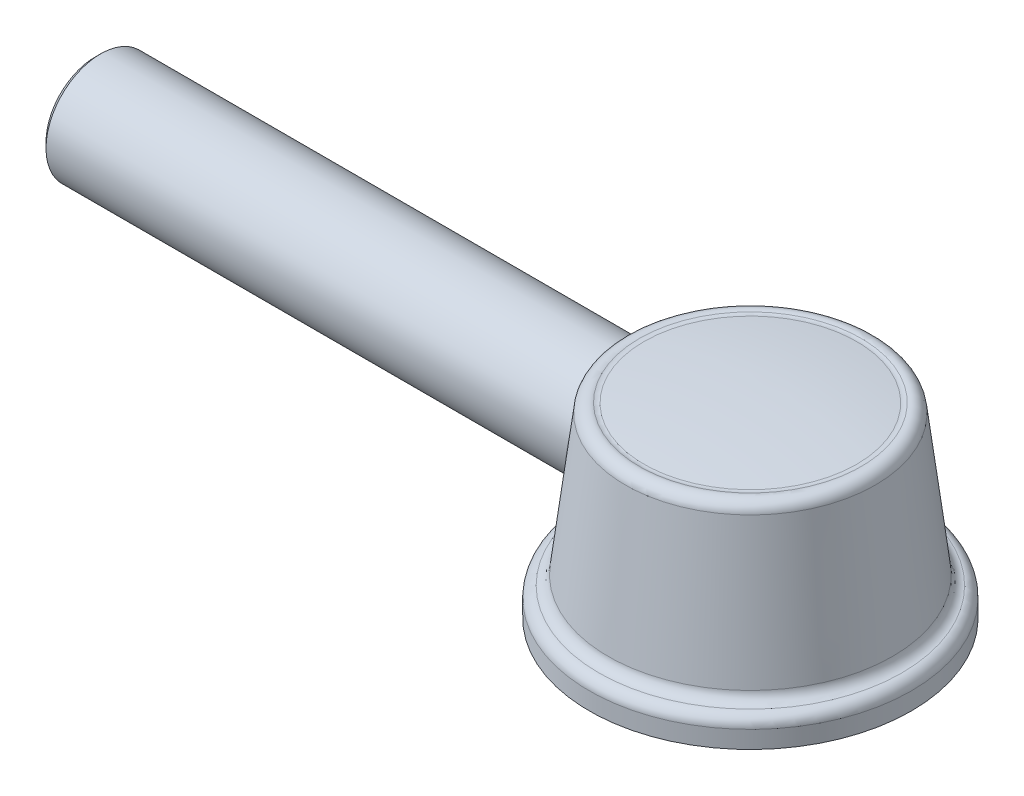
ISO-10303-21;
HEADER;
FILE_DESCRIPTION(('STEP AP214'),'2;1');
FILE_NAME('part.step','',(''),(''),'','','');
FILE_SCHEMA(('AUTOMOTIVE_DESIGN { 1 0 10303 214 1 1 1 1 }'));
ENDSEC;
DATA;
#1=APPLICATION_CONTEXT('core data for automotive mechanical design processes');
#2=APPLICATION_PROTOCOL_DEFINITION('international standard','automotive_design',2000,#1);
#3=PRODUCT_CONTEXT('',#1,'mechanical');
#4=PRODUCT('Part','Part','',(#3));
#5=PRODUCT_RELATED_PRODUCT_CATEGORY('part','',(#4));
#6=PRODUCT_DEFINITION_FORMATION('','',#4);
#7=PRODUCT_DEFINITION_CONTEXT('part definition',#1,'design');
#8=PRODUCT_DEFINITION('design','',#6,#7);
#9=PRODUCT_DEFINITION_SHAPE('','',#8);
#10=(LENGTH_UNIT() NAMED_UNIT(*) SI_UNIT(.MILLI.,.METRE.));
#11=(NAMED_UNIT(*) PLANE_ANGLE_UNIT() SI_UNIT($,.RADIAN.));
#12=(NAMED_UNIT(*) SI_UNIT($,.STERADIAN.) SOLID_ANGLE_UNIT());
#13=UNCERTAINTY_MEASURE_WITH_UNIT(LENGTH_MEASURE(1.E-05),#10,'distance_accuracy_value','');
#14=(GEOMETRIC_REPRESENTATION_CONTEXT(3) GLOBAL_UNCERTAINTY_ASSIGNED_CONTEXT((#13)) GLOBAL_UNIT_ASSIGNED_CONTEXT((#10,
#11,#12)) REPRESENTATION_CONTEXT('',''));
#15=CARTESIAN_POINT('',(0.,0.,0.));
#16=DIRECTION('',(0.,0.,1.));
#17=DIRECTION('',(1.,0.,0.));
#18=AXIS2_PLACEMENT_3D('',#15,#16,#17);
#19=CARTESIAN_POINT('',(0.,0.,0.));
#20=DIRECTION('',(-1.,0.,0.));
#21=DIRECTION('',(0.,0.,1.));
#22=AXIS2_PLACEMENT_3D('',#19,#20,#21);
#23=CYLINDRICAL_SURFACE('',#22,10.);
#24=CARTESIAN_POINT('',(94.548360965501,-5.74947677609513,-8.18190178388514));
#25=CARTESIAN_POINT('',(96.0633886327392,-6.15727673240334,-7.89533804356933));
#26=CARTESIAN_POINT('',(96.4005498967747,-7.14202274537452,-9.10377752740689));
#27=CARTESIAN_POINT('',(94.3222414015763,-6.21811205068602,-7.85258545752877));
#28=CARTESIAN_POINT('',(95.8818258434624,-6.63055982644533,-7.52742225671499));
#29=CARTESIAN_POINT('',(96.1862186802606,-7.70438507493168,-8.73915646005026));
#30=CARTESIAN_POINT('',(94.0940728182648,-6.65811418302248,-7.4833152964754));
#31=CARTESIAN_POINT('',(95.7052899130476,-7.06014408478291,-7.12479148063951));
#32=CARTESIAN_POINT('',(95.9701818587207,-8.232387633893,-8.32973627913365));
#33=CARTESIAN_POINT('',(93.6519993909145,-7.47135927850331,-6.67147115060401));
#34=CARTESIAN_POINT('',(95.3735882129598,-7.83698310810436,-6.26255135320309));
#35=CARTESIAN_POINT('',(95.5518563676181,-9.20828174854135,-7.42858602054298));
#36=CARTESIAN_POINT('',(93.4381000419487,-7.84457661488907,-6.22886915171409));
#37=CARTESIAN_POINT('',(95.218986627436,-8.18201474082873,-5.80126487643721));
#38=CARTESIAN_POINT('',(95.3495729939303,-9.65614255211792,-6.93682448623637));
#39=CARTESIAN_POINT('',(93.1398506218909,-8.34871325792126,-5.51241654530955));
#40=CARTESIAN_POINT('',(95.0118084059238,-8.63377305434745,-5.08022805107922));
#41=CARTESIAN_POINT('',(95.0676052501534,-10.2611065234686,-6.14016883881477));
#42=CARTESIAN_POINT('',(93.0433672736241,-8.50876663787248,-5.26210887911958));
#43=CARTESIAN_POINT('',(94.9459130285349,-8.77531403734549,-4.83008951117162));
#44=CARTESIAN_POINT('',(94.9764048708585,-10.4531705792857,-5.86173974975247));
#45=CARTESIAN_POINT('',(92.8611375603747,-8.80692830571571,-4.74622308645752));
#46=CARTESIAN_POINT('',(94.8237594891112,-9.03513587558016,-4.32187277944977));
#47=CARTESIAN_POINT('',(94.8041732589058,-10.8109645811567,-5.28771312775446));
#48=CARTESIAN_POINT('',(92.7753861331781,-8.9450469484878,-4.4806522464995));
#49=CARTESIAN_POINT('',(94.7676922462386,-9.1529757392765,-4.06398179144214));
#50=CARTESIAN_POINT('',(94.7231372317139,-10.9767069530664,-4.99212378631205));
#51=CARTESIAN_POINT('',(92.6168484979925,-9.19766269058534,-3.93612189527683));
#52=CARTESIAN_POINT('',(94.6659437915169,-9.36537299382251,-3.54271173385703));
#53=CARTESIAN_POINT('',(94.5733295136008,-11.279845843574,-4.38588722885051));
#54=CARTESIAN_POINT('',(92.5440547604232,-9.31217351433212,-3.65717027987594));
#55=CARTESIAN_POINT('',(94.6204625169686,-9.45949482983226,-3.27969041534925));
#56=CARTESIAN_POINT('',(94.5045507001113,-11.4172588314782,-4.0752488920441));
#57=CARTESIAN_POINT('',(92.4133704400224,-9.51610475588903,-3.08789735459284));
#58=CARTESIAN_POINT('',(94.5401559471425,-9.62494879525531,-2.74996917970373));
#59=CARTESIAN_POINT('',(94.3810809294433,-11.66197632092,-3.44118447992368));
#60=CARTESIAN_POINT('',(92.35547762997,-9.60552892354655,-2.79757775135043));
#61=CARTESIAN_POINT('',(94.5055226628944,-9.69587689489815,-2.48378911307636));
#62=CARTESIAN_POINT('',(94.3263878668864,-11.7692853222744,-3.11776032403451));
#63=CARTESIAN_POINT('',(92.2615558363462,-9.74981210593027,-2.23946629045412));
#64=CARTESIAN_POINT('',(94.4500751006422,-9.80914130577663,-1.97781735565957));
#65=CARTESIAN_POINT('',(94.2376601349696,-11.9424251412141,-2.49591855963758));
#66=CARTESIAN_POINT('',(92.2238581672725,-9.80733286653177,-1.97255506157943));
#67=CARTESIAN_POINT('',(94.4282848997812,-9.85350546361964,-1.73853450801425));
#68=CARTESIAN_POINT('',(94.2020486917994,-12.0114500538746,-2.19849155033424));
#69=CARTESIAN_POINT('',(92.1626496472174,-9.90044565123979,-1.43383098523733));
#70=CARTESIAN_POINT('',(94.3931607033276,-9.92492963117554,-1.25889828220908));
#71=CARTESIAN_POINT('',(94.1442285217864,-12.1231853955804,-1.59812355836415));
#72=CARTESIAN_POINT('',(92.1391371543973,-9.93604021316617,-1.1620187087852));
#73=CARTESIAN_POINT('',(94.3799085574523,-9.95182266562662,-1.0190878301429));
#74=CARTESIAN_POINT('',(94.1220182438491,-12.1658988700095,-1.2951832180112));
#75=CARTESIAN_POINT('',(92.1069081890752,-9.98477660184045,-0.615917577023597));
#76=CARTESIAN_POINT('',(94.3617678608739,-9.98862192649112,-0.538838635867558));
#77=CARTESIAN_POINT('',(94.0915744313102,-12.2243825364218,-0.686515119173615));
#78=CARTESIAN_POINT('',(92.0981844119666,-9.99792951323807,-0.341630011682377));
#79=CARTESIAN_POINT('',(94.3569198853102,-9.99844579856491,-0.298987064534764));
#80=CARTESIAN_POINT('',(94.0833339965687,-12.2401660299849,-0.380788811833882));
#81=CARTESIAN_POINT('',(92.0957399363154,-10.0016182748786,0.207137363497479));
#82=CARTESIAN_POINT('',(94.355553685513,-10.0012151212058,0.181324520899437));
#83=CARTESIAN_POINT('',(94.0810249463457,-12.2445925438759,0.230880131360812));
#84=CARTESIAN_POINT('',(92.1020183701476,-9.99215543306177,0.481617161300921));
#85=CARTESIAN_POINT('',(94.3590384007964,-9.99415461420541,0.421180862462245));
#86=CARTESIAN_POINT('',(94.0869555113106,-12.2332371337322,0.53682275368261));
#87=CARTESIAN_POINT('',(92.1281196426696,-9.95270840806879,1.00265515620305));
#88=CARTESIAN_POINT('',(94.3737029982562,-9.96441313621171,0.878830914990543));
#89=CARTESIAN_POINT('',(94.1116109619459,-12.185900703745,1.11756400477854));
#90=CARTESIAN_POINT('',(92.1466153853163,-9.92473449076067,1.24941517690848));
#91=CARTESIAN_POINT('',(94.3840987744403,-9.94332367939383,1.09607437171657));
#92=CARTESIAN_POINT('',(94.1290822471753,-12.1523320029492,1.39258964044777));
#93=CARTESIAN_POINT('',(92.1953952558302,-9.85067010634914,1.73945969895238));
#94=CARTESIAN_POINT('',(94.4119223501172,-9.88679071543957,1.53070014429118));
#95=CARTESIAN_POINT('',(94.175161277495,-12.0634547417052,1.93873043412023));
#96=CARTESIAN_POINT('',(92.2256830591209,-9.80457399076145,1.98274309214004));
#97=CARTESIAN_POINT('',(94.4292977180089,-9.85145398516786,1.74766892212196));
#98=CARTESIAN_POINT('',(94.2037724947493,-12.0081394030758,2.20984434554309));
#99=CARTESIAN_POINT('',(92.2974117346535,-9.69481146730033,2.46404977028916));
#100=CARTESIAN_POINT('',(94.4711961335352,-9.76602725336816,2.18109774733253));
#101=CARTESIAN_POINT('',(94.2715328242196,-11.8764243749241,2.74615621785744));
#102=CARTESIAN_POINT('',(92.3388488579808,-9.6311509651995,2.70207479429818));
#103=CARTESIAN_POINT('',(94.4956393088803,-9.71610120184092,2.39718615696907));
#104=CARTESIAN_POINT('',(94.310678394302,-11.8000317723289,3.01135613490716));
#105=CARTESIAN_POINT('',(92.4320780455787,-9.48690750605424,3.17158167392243));
#106=CARTESIAN_POINT('',(94.5517499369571,-9.6010538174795,2.82822602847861));
#107=CARTESIAN_POINT('',(94.398755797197,-11.6269396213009,3.53439551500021));
#108=CARTESIAN_POINT('',(92.4838740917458,-9.40631804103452,3.40306097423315));
#109=CARTESIAN_POINT('',(94.5833251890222,-9.53612418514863,3.04286198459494));
#110=CARTESIAN_POINT('',(94.4476913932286,-11.5302322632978,3.7922321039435));
#111=CARTESIAN_POINT('',(92.5980039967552,-9.22718766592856,3.86278306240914));
#112=CARTESIAN_POINT('',(94.6543695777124,-9.38924767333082,3.47424137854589));
#113=CARTESIAN_POINT('',(94.555524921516,-11.3152758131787,4.30421396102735));
#114=CARTESIAN_POINT('',(92.6605321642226,-9.12831253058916,4.09086214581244));
#115=CARTESIAN_POINT('',(94.6938821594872,-9.30720283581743,3.69071384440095));
#116=CARTESIAN_POINT('',(94.6146065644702,-11.1966256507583,4.55817511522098));
#117=CARTESIAN_POINT('',(92.7942019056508,-8.91465437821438,4.53765714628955));
#118=CARTESIAN_POINT('',(94.7801511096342,-9.12672988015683,4.12000565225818));
#119=CARTESIAN_POINT('',(94.7409187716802,-10.9402358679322,5.05556831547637));
#120=CARTESIAN_POINT('',(92.8653465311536,-8.79986572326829,4.7563697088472));
#121=CARTESIAN_POINT('',(94.826794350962,-9.02855004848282,4.33263749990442));
#122=CARTESIAN_POINT('',(94.8081522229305,-10.8024894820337,5.29899658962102));
#123=CARTESIAN_POINT('',(93.0898545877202,-8.43301773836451,5.39685381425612));
#124=CARTESIAN_POINT('',(94.9762618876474,-8.71099172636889,4.95960719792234));
#125=CARTESIAN_POINT('',(95.0203400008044,-10.3622719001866,6.01168244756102));
#126=CARTESIAN_POINT('',(93.2543623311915,-8.15836862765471,5.80324547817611));
#127=CARTESIAN_POINT('',(95.0895856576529,-8.46667253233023,5.36929520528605));
#128=CARTESIAN_POINT('',(95.1758480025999,-10.0326929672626,6.46364590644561));
#129=CARTESIAN_POINT('',(93.6211276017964,-7.5239325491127,6.60917633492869));
#130=CARTESIAN_POINT('',(95.3517566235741,-7.88409304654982,6.19744941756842));
#131=CARTESIAN_POINT('',(95.5226707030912,-9.27136967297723,7.35937015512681));
#132=CARTESIAN_POINT('',(93.8255417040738,-7.15817188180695,7.00329947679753));
#133=CARTESIAN_POINT('',(95.5026341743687,-7.54005512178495,6.6136018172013));
#134=CARTESIAN_POINT('',(95.7160371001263,-8.83245687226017,7.79704511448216));
#135=CARTESIAN_POINT('',(94.2431839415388,-6.37029759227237,7.72695898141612));
#136=CARTESIAN_POINT('',(95.8206688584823,-6.77857490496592,7.39001311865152));
#137=CARTESIAN_POINT('',(96.1113692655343,-7.88700772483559,8.59988941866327));
#138=CARTESIAN_POINT('',(94.4564185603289,-5.94814198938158,8.05644677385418));
#139=CARTESIAN_POINT('',(95.9875556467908,-6.36258333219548,7.75184399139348));
#140=CARTESIAN_POINT('',(96.3133413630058,-7.38042100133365,8.96500424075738));
#141=CARTESIAN_POINT('',(94.8968565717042,-5.01183710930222,8.67320899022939));
#142=CARTESIAN_POINT('',(96.3395169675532,-5.42344635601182,8.43584271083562));
#143=CARTESIAN_POINT('',(96.7309897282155,-6.25685514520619,9.64750486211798));
#144=CARTESIAN_POINT('',(95.1234399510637,-4.49274872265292,8.95341063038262));
#145=CARTESIAN_POINT('',(96.5256194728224,-4.89327470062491,8.75452780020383));
#146=CARTESIAN_POINT('',(96.9461240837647,-5.63394908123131,9.95696194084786));
#147=CARTESIAN_POINT('',(95.4419730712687,-3.67873148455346,9.30346598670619));
#148=CARTESIAN_POINT('',(96.7926032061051,-4.04769578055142,9.15795484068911));
#149=CARTESIAN_POINT('',(97.249260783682,-4.65712839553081,10.3425811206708));
#150=CARTESIAN_POINT('',(95.5446439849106,-3.40133388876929,9.40848135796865));
#151=CARTESIAN_POINT('',(96.8791625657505,-3.7591606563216,9.27964968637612));
#152=CARTESIAN_POINT('',(97.3470935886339,-4.32425128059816,10.4580679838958));
#153=CARTESIAN_POINT('',(95.740350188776,-2.83621676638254,9.59396485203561));
#154=CARTESIAN_POINT('',(97.0453718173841,-3.16883639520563,9.49605911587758));
#155=CARTESIAN_POINT('',(97.5338947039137,-3.6461107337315,10.6616238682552));
#156=CARTESIAN_POINT('',(95.8333906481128,-2.54850288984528,9.67444618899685));
#157=CARTESIAN_POINT('',(97.1251906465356,-2.86679336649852,9.59115835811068));
#158=CARTESIAN_POINT('',(97.6228677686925,-3.30085408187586,10.7497076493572));
#159=CARTESIAN_POINT('',(96.0047192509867,-1.97356102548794,9.80762301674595));
#160=CARTESIAN_POINT('',(97.2732375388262,-2.26135725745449,9.7501640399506));
#161=CARTESIAN_POINT('',(97.7871160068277,-2.61092384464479,10.8949357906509));
#162=CARTESIAN_POINT('',(96.0833719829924,-1.68658811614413,9.86109411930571));
#163=CARTESIAN_POINT('',(97.3418925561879,-1.95801291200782,9.81521910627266));
#164=CARTESIAN_POINT('',(97.8627272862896,-2.26655635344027,10.9529452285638));
#165=CARTESIAN_POINT('',(96.2272978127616,-1.10675032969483,9.94287670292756));
#166=CARTESIAN_POINT('',(97.4684789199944,-1.34407147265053,9.91695166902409));
#167=CARTESIAN_POINT('',(98.0016003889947,-1.57075100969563,11.0409447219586));
#168=CARTESIAN_POINT('',(96.2925710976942,-0.813885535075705,9.971188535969));
#169=CARTESIAN_POINT('',(97.5265632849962,-1.03305816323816,9.95386080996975));
#170=CARTESIAN_POINT('',(98.0648623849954,-1.21931325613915,11.0709351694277));
#171=CARTESIAN_POINT('',(96.4080060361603,-0.225077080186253,10.0018071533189));
#172=CARTESIAN_POINT('',(97.6303336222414,-0.407408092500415,9.99822605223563));
#173=CARTESIAN_POINT('',(98.1774221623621,-0.512743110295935,11.1020033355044));
#174=CARTESIAN_POINT('',(96.4581851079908,0.0708626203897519,10.0041440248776));
#175=CARTESIAN_POINT('',(97.6761639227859,-0.092298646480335,10.0058663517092));
#176=CARTESIAN_POINT('',(98.2267360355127,-0.157615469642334,11.1031145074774));
#177=CARTESIAN_POINT('',(96.5424171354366,0.663353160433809,9.98237461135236));
#178=CARTESIAN_POINT('',(97.7544407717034,0.538266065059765,9.99123141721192));
#179=CARTESIAN_POINT('',(98.3104545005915,0.553373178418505,11.0759846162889));
#180=CARTESIAN_POINT('',(96.5764723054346,0.959903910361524,9.95827195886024));
#181=CARTESIAN_POINT('',(97.7869840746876,0.854237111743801,9.96901711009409));
#182=CARTESIAN_POINT('',(98.3448611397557,0.909234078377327,11.0477475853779));
#183=CARTESIAN_POINT('',(96.6248606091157,1.51403702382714,9.88816265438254));
#184=CARTESIAN_POINT('',(97.8351342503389,1.44381821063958,9.899345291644));
#185=CARTESIAN_POINT('',(98.3950681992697,1.5741938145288,10.9671912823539));
#186=CARTESIAN_POINT('',(96.6411134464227,1.77189842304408,9.84523727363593));
#187=CARTESIAN_POINT('',(97.8523749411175,1.71818437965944,9.85532696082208));
#188=CARTESIAN_POINT('',(98.4126447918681,1.88362749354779,10.9182863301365));
#189=CARTESIAN_POINT('',(96.6611468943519,2.28378231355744,9.73923243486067));
#190=CARTESIAN_POINT('',(97.8765083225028,2.26179291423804,9.74482061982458));
#191=CARTESIAN_POINT('',(98.4362502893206,2.49788816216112,10.7981782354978));
#192=CARTESIAN_POINT('',(96.6649278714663,2.53780491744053,9.67615356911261));
#193=CARTESIAN_POINT('',(97.8834092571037,2.53136999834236,9.67824919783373));
#194=CARTESIAN_POINT('',(98.4422795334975,2.80271528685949,10.7269757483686));
#195=CARTESIAN_POINT('',(96.6606533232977,3.04019265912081,9.53025012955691));
#196=CARTESIAN_POINT('',(97.8874685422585,3.06312706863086,9.52336222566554));
#197=CARTESIAN_POINT('',(98.4433705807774,3.40558057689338,10.5627576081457));
#198=CARTESIAN_POINT('',(96.6525914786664,3.28855470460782,9.44741503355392));
#199=CARTESIAN_POINT('',(97.8846055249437,3.32560527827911,9.43490147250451));
#200=CARTESIAN_POINT('',(98.4384265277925,3.70361503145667,10.4697303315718));
#201=CARTESIAN_POINT('',(96.6256743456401,3.77761273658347,9.26272333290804));
#202=CARTESIAN_POINT('',(97.870112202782,3.84078385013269,9.23738213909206));
#203=CARTESIAN_POINT('',(98.4185232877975,4.29048466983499,10.2626963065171));
#204=CARTESIAN_POINT('',(96.6068191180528,4.01830876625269,9.16086683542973));
#205=CARTESIAN_POINT('',(97.8584470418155,4.09373929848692,9.12815123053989));
#206=CARTESIAN_POINT('',(98.4035641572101,4.57931990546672,10.1486896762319));
#207=CARTESIAN_POINT('',(96.5373316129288,4.71326852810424,8.83412500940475));
#208=CARTESIAN_POINT('',(97.8128907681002,4.82253781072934,8.77738939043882));
#209=CARTESIAN_POINT('',(98.3465333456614,5.41327161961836,9.78345725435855));
#210=CARTESIAN_POINT('',(96.4734999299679,5.15492856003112,8.5837875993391));
#211=CARTESIAN_POINT('',(97.76831407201,5.28201729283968,8.50840209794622));
#212=CARTESIAN_POINT('',(98.2921967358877,5.94326365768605,9.50420091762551));
#213=CARTESIAN_POINT('',(96.3220269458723,5.99261840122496,8.02139823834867));
#214=CARTESIAN_POINT('',(97.6617457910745,6.14422300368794,7.90957444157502));
#215=CARTESIAN_POINT('',(98.1612330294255,6.94849146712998,8.87792713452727));
#216=CARTESIAN_POINT('',(96.2344249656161,6.38872204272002,7.70944843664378));
#217=CARTESIAN_POINT('',(97.5994324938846,6.54759888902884,7.57829199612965));
#218=CARTESIAN_POINT('',(98.0846427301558,7.42381583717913,8.53102185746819));
#219=CARTESIAN_POINT('',(96.1109037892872,6.87990220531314,7.25907597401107));
#220=CARTESIAN_POINT('',(97.5128839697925,7.03950113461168,7.10791292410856));
#221=CARTESIAN_POINT('',(97.9760286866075,8.01323203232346,8.03078622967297));
#222=CARTESIAN_POINT('',(96.0797666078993,6.99855876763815,7.14474047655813));
#223=CARTESIAN_POINT('',(97.4910236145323,7.15833182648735,6.98829301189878));
#224=CARTESIAN_POINT('',(97.9486018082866,8.15561990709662,7.90383717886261));
#225=CARTESIAN_POINT('',(96.0167551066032,7.23003166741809,6.91040855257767));
#226=CARTESIAN_POINT('',(97.4469440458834,7.38914644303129,6.74400824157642));
#227=CARTESIAN_POINT('',(97.8930202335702,8.43338738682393,7.64374154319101));
#228=CARTESIAN_POINT('',(95.9848807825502,7.34284797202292,6.7904120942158));
#229=CARTESIAN_POINT('',(97.4247208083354,7.50111037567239,6.61930669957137));
#230=CARTESIAN_POINT('',(97.8648655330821,8.56876695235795,7.51059492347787));
#231=CARTESIAN_POINT('',(95.8988765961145,7.63768723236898,6.46086350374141));
#232=CARTESIAN_POINT('',(97.3649332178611,7.79285084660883,6.27761477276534));
#233=CARTESIAN_POINT('',(97.788812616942,8.92257406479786,7.14504467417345));
#234=CARTESIAN_POINT('',(95.8444723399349,7.81412303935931,6.2463214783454));
#235=CARTESIAN_POINT('',(97.3274589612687,7.96556990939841,6.05680682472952));
#236=CARTESIAN_POINT('',(97.7406136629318,9.13429703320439,6.90718172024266));
#237=CARTESIAN_POINT('',(95.7368686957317,8.14864320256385,5.80316373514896));
#238=CARTESIAN_POINT('',(97.2540252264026,8.29046445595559,5.60407484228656));
#239=CARTESIAN_POINT('',(97.6451588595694,9.53572122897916,6.41607387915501));
#240=CARTESIAN_POINT('',(95.6836694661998,8.30672515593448,5.57454618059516));
#241=CARTESIAN_POINT('',(97.2180829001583,8.4424478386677,5.37208481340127));
#242=CARTESIAN_POINT('',(97.5979031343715,9.7254195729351,6.16282698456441));
#243=CARTESIAN_POINT('',(95.5802693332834,8.60386379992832,5.10402963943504));
#244=CARTESIAN_POINT('',(97.1489228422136,8.72584226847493,4.89829493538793));
#245=CARTESIAN_POINT('',(97.5059709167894,10.0819859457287,5.64182049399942));
#246=CARTESIAN_POINT('',(95.5300757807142,8.74287484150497,4.86210066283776));
#247=CARTESIAN_POINT('',(97.1157492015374,8.85697380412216,4.65649797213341));
#248=CARTESIAN_POINT('',(97.4613007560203,10.2487991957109,5.37402814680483));
#249=CARTESIAN_POINT('',(95.4346259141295,9.00036669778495,4.36705854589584));
#250=CARTESIAN_POINT('',(97.0533052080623,9.09798194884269,4.165531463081));
#251=CARTESIAN_POINT('',(97.3762993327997,10.557789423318,4.82623966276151));
#252=CARTESIAN_POINT('',(95.3893670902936,9.11885796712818,4.1139511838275));
#253=CARTESIAN_POINT('',(97.0240842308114,9.20762379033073,3.91647835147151));
#254=CARTESIAN_POINT('',(97.335965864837,10.6999789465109,4.54624983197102));
#255=CARTESIAN_POINT('',(95.305265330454,9.33466544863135,3.59756447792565));
#256=CARTESIAN_POINT('',(96.9702997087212,9.40590602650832,3.41204217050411));
#257=CARTESIAN_POINT('',(97.2609826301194,10.9589479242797,3.97516744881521));
#258=CARTESIAN_POINT('',(95.2664347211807,9.43194108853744,3.3342667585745));
#259=CARTESIAN_POINT('',(96.9458046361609,9.49426019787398,3.15686018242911));
#260=CARTESIAN_POINT('',(97.2263437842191,11.0756786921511,3.68405485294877));
#261=CARTESIAN_POINT('',(95.1966782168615,9.60414554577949,2.79985140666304));
#262=CARTESIAN_POINT('',(96.9021538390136,9.64976524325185,2.64219707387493));
#263=CARTESIAN_POINT('',(97.1640983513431,11.2823240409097,3.09330482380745));
#264=CARTESIAN_POINT('',(95.1657494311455,9.6790825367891,2.52873667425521));
#265=CARTESIAN_POINT('',(96.8830546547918,9.71670277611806,2.3830152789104));
#266=CARTESIAN_POINT('',(97.1364891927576,11.3722484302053,2.79367055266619));
#267=CARTESIAN_POINT('',(95.1128947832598,9.80590165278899,1.98074125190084));
#268=CARTESIAN_POINT('',(96.8506010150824,9.82953908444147,1.86169917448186));
#269=CARTESIAN_POINT('',(97.0892984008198,11.5244313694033,2.1881195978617));
#270=CARTESIAN_POINT('',(95.0909633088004,9.85779815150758,1.70386426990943));
#271=CARTESIAN_POINT('',(96.8372927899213,9.87527301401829,1.59994002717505));
#272=CARTESIAN_POINT('',(97.0697117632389,11.5867071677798,1.88220695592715));
#273=CARTESIAN_POINT('',(95.0568636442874,9.93807244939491,1.14631241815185));
#274=CARTESIAN_POINT('',(96.816653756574,9.94590706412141,1.07439893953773));
#275=CARTESIAN_POINT('',(97.0392549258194,11.6830363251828,1.266242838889));
#276=CARTESIAN_POINT('',(95.044694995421,9.9664513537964,0.865637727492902));
#277=CARTESIAN_POINT('',(96.8093573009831,9.97068853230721,0.811047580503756));
#278=CARTESIAN_POINT('',(97.0283843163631,11.7170910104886,0.95619155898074));
#279=CARTESIAN_POINT('',(95.0308422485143,9.99872979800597,0.31405278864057));
#280=CARTESIAN_POINT('',(96.8010431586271,9.99890715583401,0.293900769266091));
#281=CARTESIAN_POINT('',(97.0160090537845,11.7558251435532,0.346898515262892));
#282=CARTESIAN_POINT('',(95.0287559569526,10.0035684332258,0.0432041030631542));
#283=CARTESIAN_POINT('',(96.7997979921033,10.0031176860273,0.0405527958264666));
#284=CARTESIAN_POINT('',(97.0141451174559,11.7616315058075,0.0477238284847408));
#285=CARTESIAN_POINT('',(95.0340466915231,9.99126156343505,-0.497927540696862));
#286=CARTESIAN_POINT('',(96.8029688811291,9.99237032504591,-0.466334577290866));
#287=CARTESIAN_POINT('',(97.0188717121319,11.7468632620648,-0.550009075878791));
#288=CARTESIAN_POINT('',(95.041423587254,9.97411636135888,-0.768210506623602));
#289=CARTESIAN_POINT('',(96.8073796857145,9.97743022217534,-0.719459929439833));
#290=CARTESIAN_POINT('',(97.0254621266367,11.7262890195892,-0.848567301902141));
#291=CARTESIAN_POINT('',(95.0653953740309,9.9180106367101,-1.30622519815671));
#292=CARTESIAN_POINT('',(96.821820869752,9.9282399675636,-1.22507279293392));
#293=CARTESIAN_POINT('',(97.0468753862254,11.6589621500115,-1.44290373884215));
#294=CARTESIAN_POINT('',(95.0819907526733,9.87904896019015,-1.57395678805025));
#295=CARTESIAN_POINT('',(96.8318286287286,9.89406720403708,-1.4771636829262));
#296=CARTESIAN_POINT('',(97.0616986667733,11.6122081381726,-1.73868180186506));
#297=CARTESIAN_POINT('',(95.1238490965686,9.77968468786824,-2.10492773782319));
#298=CARTESIAN_POINT('',(96.8573279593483,9.80619849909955,-1.97972851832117));
#299=CARTESIAN_POINT('',(97.0990793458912,11.4929710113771,-2.32534186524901));
#300=CARTESIAN_POINT('',(95.1491120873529,9.7192820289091,-2.36816708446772));
#301=CARTESIAN_POINT('',(96.8727816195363,9.75263541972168,-2.2298444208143));
#302=CARTESIAN_POINT('',(97.121636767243,11.420487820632,-2.61622385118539));
#303=CARTESIAN_POINT('',(95.2069822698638,9.57878166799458,-2.88395230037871));
#304=CARTESIAN_POINT('',(96.9086085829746,9.62682064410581,-2.7231364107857));
#305=CARTESIAN_POINT('',(97.173293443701,11.2518873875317,-3.18626440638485));
#306=CARTESIAN_POINT('',(95.2394586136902,9.49903277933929,-3.13660359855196));
#307=CARTESIAN_POINT('',(96.9288469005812,9.55507315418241,-2.96604951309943));
#308=CARTESIAN_POINT('',(97.2022761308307,11.1561887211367,-3.46553790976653));
#309=CARTESIAN_POINT('',(95.3109717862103,9.3199717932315,-3.63429493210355));
#310=CARTESIAN_POINT('',(96.973975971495,9.39229359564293,-3.44799270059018));
#311=CARTESIAN_POINT('',(97.2660699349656,10.9413155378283,-4.01578606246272));
#312=CARTESIAN_POINT('',(95.3500107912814,9.22065320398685,-3.87933241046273));
#313=CARTESIAN_POINT('',(96.9988181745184,9.30145050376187,-3.68680082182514));
#314=CARTESIAN_POINT('',(97.3008829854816,10.8221332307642,-4.28675792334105));
#315=CARTESIAN_POINT('',(95.4334178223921,9.00322008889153,-4.36023324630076));
#316=CARTESIAN_POINT('',(97.0525756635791,9.10041532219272,-4.15899664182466));
#317=CARTESIAN_POINT('',(97.375220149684,10.5612134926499,-4.81869286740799));
#318=CARTESIAN_POINT('',(95.4777850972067,8.88510821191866,-4.59609789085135));
#319=CARTESIAN_POINT('',(97.0814420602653,8.99043420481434,-4.39223651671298));
#320=CARTESIAN_POINT('',(97.4147435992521,10.4194792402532,-5.07965735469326));
#321=CARTESIAN_POINT('',(95.57045593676,8.6308876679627,-5.05739310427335));
#322=CARTESIAN_POINT('',(97.1424556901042,8.75120684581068,-4.8517342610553));
#323=CARTESIAN_POINT('',(97.4972359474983,10.1144145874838,-5.59019742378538));
#324=CARTESIAN_POINT('',(95.6187609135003,8.49477253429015,-5.28281988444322));
#325=CARTESIAN_POINT('',(97.1745640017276,8.62215752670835,-5.0779183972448));
#326=CARTESIAN_POINT('',(97.5402060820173,9.95107642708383,-5.83976886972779));
#327=CARTESIAN_POINT('',(95.7721109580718,8.0466792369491,-5.96276192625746));
#328=CARTESIAN_POINT('',(97.2772450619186,8.19468170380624,-5.76217840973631));
#329=CARTESIAN_POINT('',(97.6764866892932,9.41336447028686,-6.59280740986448));
#330=CARTESIAN_POINT('',(95.8813516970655,7.70537601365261,-6.39775120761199));
#331=CARTESIAN_POINT('',(97.3521388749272,7.86307435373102,-6.20889777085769));
#332=CARTESIAN_POINT('',(97.7733834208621,9.00380060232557,-7.07495324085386));
#333=CARTESIAN_POINT('',(96.0948938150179,6.95515137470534,-7.20625322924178));
#334=CARTESIAN_POINT('',(97.5008037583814,7.119258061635,-7.04801052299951));
#335=CARTESIAN_POINT('',(97.9620551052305,8.10353103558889,-7.97198252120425));
#336=CARTESIAN_POINT('',(96.1991932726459,6.54620392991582,-7.57974219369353));
#337=CARTESIAN_POINT('',(97.5746534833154,6.70797528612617,-7.44158239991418));
#338=CARTESIAN_POINT('',(98.0538280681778,7.61279410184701,-8.3868399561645));
#339=CARTESIAN_POINT('',(96.3405486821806,5.88265522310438,-8.09171958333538));
#340=CARTESIAN_POINT('',(97.6748695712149,6.02909995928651,-7.98555019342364));
#341=CARTESIAN_POINT('',(98.1771735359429,6.81653565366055,-8.95627178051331));
#342=CARTESIAN_POINT('',(96.3857219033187,5.64911881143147,-8.25647194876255));
#343=CARTESIAN_POINT('',(97.7068288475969,5.78940536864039,-8.16092163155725));
#344=CARTESIAN_POINT('',(98.2163882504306,6.536291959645,-9.13965786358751));
#345=CARTESIAN_POINT('',(96.4678892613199,5.16812419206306,-8.56575304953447));
#346=CARTESIAN_POINT('',(97.7644762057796,5.29305998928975,-8.49072345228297));
#347=CARTESIAN_POINT('',(98.2871736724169,5.95909841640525,-9.48421266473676));
#348=CARTESIAN_POINT('',(96.504887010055,4.92067219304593,-8.71029070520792));
#349=CARTESIAN_POINT('',(97.7902321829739,5.03629640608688,-8.64544294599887));
#350=CARTESIAN_POINT('',(98.3187477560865,5.66215601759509,-9.64539118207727));
#351=CARTESIAN_POINT('',(96.568493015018,4.41365169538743,-8.97785214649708));
#352=CARTESIAN_POINT('',(97.8334856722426,4.50795390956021,-8.93189848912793));
#353=CARTESIAN_POINT('',(98.3722268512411,5.05373142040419,-9.94407581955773));
#354=CARTESIAN_POINT('',(96.5951058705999,4.15408861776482,-9.10088544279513));
#355=CARTESIAN_POINT('',(97.8510532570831,4.2361661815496,-9.06392124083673));
#356=CARTESIAN_POINT('',(98.3941361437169,4.74225572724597,-10.0815924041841));
#357=CARTESIAN_POINT('',(96.6360039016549,3.62475633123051,-9.32435733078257));
#358=CARTESIAN_POINT('',(97.8761569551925,3.68019305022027,-9.30325607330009));
#359=CARTESIAN_POINT('',(98.4265080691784,4.10705698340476,-10.3317236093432));
#360=CARTESIAN_POINT('',(96.650290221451,3.3549880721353,-9.42479801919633));
#361=CARTESIAN_POINT('',(97.8837494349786,3.39570453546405,-9.41081972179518));
#362=CARTESIAN_POINT('',(98.43697176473,3.78333507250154,-10.4443405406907));
#363=CARTESIAN_POINT('',(96.6644801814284,2.82572583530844,-9.59622030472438));
#364=CARTESIAN_POINT('',(97.8873594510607,2.83640093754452,-9.59349925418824));
#365=CARTESIAN_POINT('',(98.4447497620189,3.14822038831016,-10.6369368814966));
#366=CARTESIAN_POINT('',(96.6652751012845,2.56673752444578,-9.66871418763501));
#367=CARTESIAN_POINT('',(97.8841386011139,2.56192071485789,-9.67044883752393));
#368=CARTESIAN_POINT('',(98.4428903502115,2.83743441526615,-10.7185858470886));
#369=CARTESIAN_POINT('',(96.6538897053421,2.04395056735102,-9.79256930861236));
#370=CARTESIAN_POINT('',(97.8669513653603,2.0073046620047,-9.8006585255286));
#371=CARTESIAN_POINT('',(98.4271545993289,2.21009006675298,-10.8585160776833));
#372=CARTESIAN_POINT('',(96.6417099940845,1.7801521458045,-9.84393153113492));
#373=CARTESIAN_POINT('',(97.8529868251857,1.72681706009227,-9.85403138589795));
#374=CARTESIAN_POINT('',(98.413278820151,1.89353196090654,-10.9167984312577));
#375=CARTESIAN_POINT('',(96.6039898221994,1.24999820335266,-9.9251905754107));
#376=CARTESIAN_POINT('',(97.8140012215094,1.16302719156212,-9.93659611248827));
#377=CARTESIAN_POINT('',(98.3731637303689,1.25734722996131,-11.0095892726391));
#378=CARTESIAN_POINT('',(96.5784527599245,0.983643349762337,-9.95509285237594));
#379=CARTESIAN_POINT('',(97.7889552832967,0.87934939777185,-9.96584544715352));
#380=CARTESIAN_POINT('',(98.34692756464,0.937721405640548,-11.0441038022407));
#381=CARTESIAN_POINT('',(96.5141337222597,0.450508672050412,-9.99342107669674));
#382=CARTESIAN_POINT('',(97.7279722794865,0.311895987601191,-10.0001268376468));
#383=CARTESIAN_POINT('',(98.2822064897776,0.297959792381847,-11.0893098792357));
#384=CARTESIAN_POINT('',(96.4753520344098,0.183728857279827,-10.0018474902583));
#385=CARTESIAN_POINT('',(97.6919783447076,0.0277400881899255,-10.0051462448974));
#386=CARTESIAN_POINT('',(98.2437218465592,-0.0221759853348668,-11.1000019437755));
#387=CARTESIAN_POINT('',(96.3879499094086,-0.331594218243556,-9.99761269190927));
#388=CARTESIAN_POINT('',(97.6122928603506,-0.520340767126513,-9.99175319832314));
#389=CARTESIAN_POINT('',(98.1578242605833,-0.640563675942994,-11.0978756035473));
#390=CARTESIAN_POINT('',(96.3400914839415,-0.580239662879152,-9.98623053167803));
#391=CARTESIAN_POINT('',(97.5691422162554,-0.784780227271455,-9.9747128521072));
#392=CARTESIAN_POINT('',(98.1111155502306,-0.938938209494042,-11.0864781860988));
#393=CARTESIAN_POINT('',(96.2340561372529,-1.07455096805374,-9.94519360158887));
#394=CARTESIAN_POINT('',(97.4746190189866,-1.30948933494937,-9.92020314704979));
#395=CARTESIAN_POINT('',(98.0081673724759,-1.53211177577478,-11.0433553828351));
#396=CARTESIAN_POINT('',(96.1758756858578,-1.32021577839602,-9.91553257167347));
#397=CARTESIAN_POINT('',(97.4231598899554,-1.57003279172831,-9.8826187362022));
#398=CARTESIAN_POINT('',(97.9519246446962,-1.82690954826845,-11.0116230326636));
#399=CARTESIAN_POINT('',(96.0502745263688,-1.80704023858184,-9.83846119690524));
#400=CARTESIAN_POINT('',(97.3130898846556,-2.08501498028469,-9.78778771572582));
#401=CARTESIAN_POINT('',(97.8309122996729,-2.41109890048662,-10.9283855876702));
#402=CARTESIAN_POINT('',(95.9828551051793,-2.0482005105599,-9.79105332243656));
#403=CARTESIAN_POINT('',(97.2543868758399,-2.33969560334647,-9.73039718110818));
#404=CARTESIAN_POINT('',(97.7661438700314,-2.70049122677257,-10.8768832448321));
#405=CARTESIAN_POINT('',(95.8400063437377,-2.52486234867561,-9.67910579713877));
#406=CARTESIAN_POINT('',(97.1310308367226,-2.84148322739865,-9.59688385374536));
#407=CARTESIAN_POINT('',(97.629223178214,-3.27248543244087,-10.7547701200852));
#408=CARTESIAN_POINT('',(95.7645739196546,-2.76036169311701,-9.61455953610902));
#409=CARTESIAN_POINT('',(97.0662801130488,-3.08878501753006,-9.52057694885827));
#410=CARTESIAN_POINT('',(97.557068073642,-3.55508464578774,-10.6841519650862));
#411=CARTESIAN_POINT('',(95.5176438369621,-3.48794370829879,-9.38634736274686));
#412=CARTESIAN_POINT('',(96.8552256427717,-3.85274826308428,-9.25247862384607));
#413=CARTESIAN_POINT('',(97.3212460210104,-4.42818306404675,-10.4338843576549));
#414=CARTESIAN_POINT('',(95.3341637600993,-3.96832479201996,-9.19325366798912));
#415=CARTESIAN_POINT('',(96.7007592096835,-4.35172488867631,-9.02858760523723));
#416=CARTESIAN_POINT('',(97.1465475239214,-5.00464036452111,-10.2213730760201));
#417=CARTESIAN_POINT('',(94.950459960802,-4.8899175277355,-8.73804699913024));
#418=CARTESIAN_POINT('',(96.3843431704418,-5.29736456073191,-8.51155815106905));
#419=CARTESIAN_POINT('',(96.7818747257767,-6.1105516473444,-9.71909704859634));
#420=CARTESIAN_POINT('',(94.7502269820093,-5.33110724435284,-8.47589569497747));
#421=CARTESIAN_POINT('',(96.2217593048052,-5.74444896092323,-8.21625771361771));
#422=CARTESIAN_POINT('',(96.5918919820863,-6.63997930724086,-9.42928939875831));
#423=CARTESIAN_POINT('',(94.548360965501,-5.74947677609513,-8.18190178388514));
#424=CARTESIAN_POINT('',(96.0633886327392,-6.15727673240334,-7.89533804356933));
#425=CARTESIAN_POINT('',(96.4005498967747,-7.14202274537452,-9.10377752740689));
#426=(BOUNDED_SURFACE() B_SPLINE_SURFACE(3,2,((#24,#25,#26),(#27,#28,#29),(#30,#31,#32),(#33,
#34,#35),(#36,#37,#38),(#39,#40,#41),(#42,#43,#44),(#45,#46,#47),(#48,#49,#50),(#51,#52,#53),
(#54,#55,#56),(#57,#58,#59),(#60,#61,#62),(#63,#64,#65),(#66,#67,#68),(#69,#70,#71),(#72,#73,
#74),(#75,#76,#77),(#78,#79,#80),(#81,#82,#83),(#84,#85,#86),(#87,#88,#89),(#90,#91,#92),(#93,
#94,#95),(#96,#97,#98),(#99,#100,#101),(#102,#103,#104),(#105,#106,#107),(#108,#109,#110),(#111,
#112,#113),(#114,#115,#116),(#117,#118,#119),(#120,#121,#122),(#123,#124,#125),(#126,#127,#128),
(#129,#130,#131),(#132,#133,#134),(#135,#136,#137),(#138,#139,#140),(#141,#142,#143),(#144,#145,
#146),(#147,#148,#149),(#150,#151,#152),(#153,#154,#155),(#156,#157,#158),(#159,#160,#161),
(#162,#163,#164),(#165,#166,#167),(#168,#169,#170),(#171,#172,#173),(#174,#175,#176),(#177,#178,
#179),(#180,#181,#182),(#183,#184,#185),(#186,#187,#188),(#189,#190,#191),(#192,#193,#194),
(#195,#196,#197),(#198,#199,#200),(#201,#202,#203),(#204,#205,#206),(#207,#208,#209),(#210,#211,
#212),(#213,#214,#215),(#216,#217,#218),(#219,#220,#221),(#222,#223,#224),(#225,#226,#227),
(#228,#229,#230),(#231,#232,#233),(#234,#235,#236),(#237,#238,#239),(#240,#241,#242),(#243,#244,
#245),(#246,#247,#248),(#249,#250,#251),(#252,#253,#254),(#255,#256,#257),(#258,#259,#260),
(#261,#262,#263),(#264,#265,#266),(#267,#268,#269),(#270,#271,#272),(#273,#274,#275),(#276,#277,
#278),(#279,#280,#281),(#282,#283,#284),(#285,#286,#287),(#288,#289,#290),(#291,#292,#293),
(#294,#295,#296),(#297,#298,#299),(#300,#301,#302),(#303,#304,#305),(#306,#307,#308),(#309,#310,
#311),(#312,#313,#314),(#315,#316,#317),(#318,#319,#320),(#321,#322,#323),(#324,#325,#326),
(#327,#328,#329),(#330,#331,#332),(#333,#334,#335),(#336,#337,#338),(#339,#340,#341),(#342,#343,
#344),(#345,#346,#347),(#348,#349,#350),(#351,#352,#353),(#354,#355,#356),(#357,#358,#359),
(#360,#361,#362),(#363,#364,#365),(#366,#367,#368),(#369,#370,#371),(#372,#373,#374),(#375,#376,
#377),(#378,#379,#380),(#381,#382,#383),(#384,#385,#386),(#387,#388,#389),(#390,#391,#392),
(#393,#394,#395),(#396,#397,#398),(#399,#400,#401),(#402,#403,#404),(#405,#406,#407),(#408,#409,
#410),(#411,#412,#413),(#414,#415,#416),(#417,#418,#419),(#420,#421,#422),(#423,#424,#425)),
.UNSPECIFIED.,.T.,.F.,.F.) B_SPLINE_SURFACE_WITH_KNOTS((4,2,2,2,2,2,2,2,2,2,2,2,2,2,2,2,2,2,2,2,
2,2,2,2,2,2,2,2,2,2,2,2,2,2,2,2,2,2,2,2,2,2,2,2,2,2,2,2,2,2,2,2,2,2,2,2,2,2,2,2,2,2,2,2,2,2,4),
(3,3),(0.,2.16869673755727,4.3382238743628,5.44499075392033,6.55123359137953,7.65683148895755,
8.76226403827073,9.75033572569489,10.7382930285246,11.7257622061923,12.713174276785,
13.6078738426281,14.5028524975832,15.3975305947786,16.2925532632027,17.205929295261,
18.1196297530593,19.9459624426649,21.9682970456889,23.9921455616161,26.2099714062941,
27.3200967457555,28.429623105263,29.5051627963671,30.5806874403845,31.6549661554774,
32.7290972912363,33.670245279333,34.6113656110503,35.552988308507,36.4946057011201,
38.3240089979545,40.1504043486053,40.7507574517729,41.3511139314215,42.363118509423,
43.3752554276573,44.3897742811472,45.4037747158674,46.419697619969,47.4352483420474,
48.4501646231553,49.465033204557,50.4390635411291,51.413080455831,52.387148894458,
53.3612202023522,54.3188872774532,55.2768725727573,56.2347229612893,57.192918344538,
59.2006472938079,61.2091506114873,62.2457877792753,63.2819660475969,64.3176848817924,
65.3533075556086,66.320226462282,67.287100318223,68.2537283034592,69.2203353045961,
70.1268192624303,71.033613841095,71.9402822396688,72.8473008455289,74.7823072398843,
76.7183899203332),(0.,1.),
.UNSPECIFIED.) GEOMETRIC_REPRESENTATION_ITEM() RATIONAL_B_SPLINE_SURFACE(((1.,0.781839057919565,
1.),(1.,0.77226104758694,1.),(1.,0.762226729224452,1.),(1.,0.742074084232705,1.),(1.,
0.731955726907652,1.),(1.,0.717407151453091,1.),(1.,0.712618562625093,1.),(1.,0.703443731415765,
1.),(1.,0.699057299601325,1.),(1.,0.690845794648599,1.),(1.,0.68702039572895,1.),(1.,
0.680083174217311,1.),(1.,0.676971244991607,1.),(1.,0.671885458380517,1.),(1.,0.66982585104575,
1.),(1.,0.666467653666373,1.),(1.,0.665168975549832,1.),(1.,0.663386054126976,1.),(1.,
0.662901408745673,1.),(1.,0.662765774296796,1.),(1.,0.663114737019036,1.),(1.,0.664559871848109,
1.),(1.,0.665582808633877,1.),(1.,0.668266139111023,1.),(1.,0.669926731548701,1.),(1.,
0.673830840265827,1.),(1.,0.676074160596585,1.),(1.,0.681076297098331,1.),(1.,0.683835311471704,
1.),(1.,0.68985140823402,1.),(1.,0.693117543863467,1.),(1.,0.700017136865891,1.),(1.,
0.703650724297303,1.),(1.,0.71496779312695,1.),(1.,0.723071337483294,1.),(1.,0.740605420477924,
1.),(1.,0.750085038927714,1.),(1.,0.768797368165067,1.),(1.,0.778029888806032,1.),(1.,
0.796437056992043,1.),(1.,0.805521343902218,1.),(1.,0.81777496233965,1.),(1.,0.821632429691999,
1.),(1.,0.828811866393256,1.),(1.,0.83213412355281,1.),(1.,0.838077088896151,1.),(1.,
0.840716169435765,1.),(1.,0.845364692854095,1.),(1.,0.847374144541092,1.),(1.,0.850716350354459,
1.),(1.,0.852049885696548,1.),(1.,0.854016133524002,1.),(1.,0.854648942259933,1.),(1.,
0.855173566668,1.),(1.,0.855147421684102,1.),(1.,0.854564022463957,1.),(1.,0.8540067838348,1.),
(1.,0.852385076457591,1.),(1.,0.851320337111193,1.),(1.,0.848722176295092,1.),(1.,
0.847188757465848,1.),(1.,0.842052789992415,1.),(1.,0.837862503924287,1.),(1.,0.828345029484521,
1.),(1.,0.82301972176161,1.),(1.,0.81555775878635,1.),(1.,0.813680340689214,1.),(1.,
0.809882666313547,1.),(1.,0.807962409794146,1.),(1.,0.802776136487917,1.),(1.,0.79949017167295,
1.),(1.,0.792964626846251,1.),(1.,0.789725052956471,1.),(1.,0.783395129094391,1.),(1.,
0.780305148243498,1.),(1.,0.774395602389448,1.),(1.,0.771575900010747,1.),(1.,0.766307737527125,
1.),(1.,0.763859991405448,1.),(1.,0.759442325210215,1.),(1.,0.757472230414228,1.),(1.,
0.754093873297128,1.),(1.,0.752685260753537,1.),(1.,0.750490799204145,1.),(1.,0.749704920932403,
1.),(1.,0.748809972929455,1.),(1.,0.748674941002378,1.),(1.,0.749016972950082,1.),(1.,
0.749494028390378,1.),(1.,0.751040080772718,1.),(1.,0.752109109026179,1.),(1.,0.754794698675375,
1.),(1.,0.756411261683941,1.),(1.,0.760095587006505,1.),(1.,0.762155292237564,1.),(1.,
0.766665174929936,1.),(1.,0.769115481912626,1.),(1.,0.774319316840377,1.),(1.,0.777072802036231,
1.),(1.,0.782791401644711,1.),(1.,0.785756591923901,1.),(1.,0.795120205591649,1.),(1.,
0.801721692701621,1.),(1.,0.814592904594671,1.),(1.,0.820862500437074,1.),(1.,0.829526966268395,
1.),(1.,0.83232878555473,1.),(1.,0.837546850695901,1.),(1.,0.839963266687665,1.),(1.,
0.844325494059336,1.),(1.,0.846271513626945,1.),(1.,0.84962253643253,1.),(1.,0.851027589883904,
1.),(1.,0.853166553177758,1.),(1.,0.853938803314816,1.),(1.,0.85493027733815,1.),(1.,
0.855149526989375,1.),(1.,0.855018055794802,1.),(1.,0.85466747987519,1.),(1.,0.853395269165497,
1.),(1.,0.852473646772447,1.),(1.,0.85014758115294,1.),(1.,0.848776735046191,1.),(1.,
0.845565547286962,1.),(1.,0.843725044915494,1.),(1.,0.839604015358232,1.),(1.,0.837323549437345,
1.),(1.,0.832358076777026,1.),(1.,0.829672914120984,1.),(1.,0.820682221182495,1.),(1.,
0.813722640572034,1.),(1.,0.798576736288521,1.),(1.,0.790389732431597,1.),(1.,0.781839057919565,1.))) REPRESENTATION_ITEM('') SURFACE());
#427=CARTESIAN_POINT('',(94.548360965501,-5.74947677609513,-8.18190178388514));
#428=CARTESIAN_POINT('',(94.3222414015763,-6.21811205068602,-7.85258545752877));
#429=CARTESIAN_POINT('',(94.0940728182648,-6.65811418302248,-7.4833152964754));
#430=CARTESIAN_POINT('',(93.6519993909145,-7.47135927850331,-6.67147115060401));
#431=CARTESIAN_POINT('',(93.4381000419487,-7.84457661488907,-6.2288691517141));
#432=CARTESIAN_POINT('',(93.1398506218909,-8.34871325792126,-5.51241654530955));
#433=CARTESIAN_POINT('',(93.0433672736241,-8.50876663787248,-5.26210887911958));
#434=CARTESIAN_POINT('',(92.8611375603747,-8.80692830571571,-4.74622308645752));
#435=CARTESIAN_POINT('',(92.7753861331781,-8.9450469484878,-4.4806522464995));
#436=CARTESIAN_POINT('',(92.6168484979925,-9.19766269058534,-3.93612189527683));
#437=CARTESIAN_POINT('',(92.5440547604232,-9.31217351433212,-3.65717027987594));
#438=CARTESIAN_POINT('',(92.4133704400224,-9.51610475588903,-3.08789735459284));
#439=CARTESIAN_POINT('',(92.35547762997,-9.60552892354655,-2.79757775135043));
#440=CARTESIAN_POINT('',(92.2615558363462,-9.74981210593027,-2.23946629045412));
#441=CARTESIAN_POINT('',(92.2238581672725,-9.80733286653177,-1.97255506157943));
#442=CARTESIAN_POINT('',(92.1626496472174,-9.90044565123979,-1.43383098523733));
#443=CARTESIAN_POINT('',(92.1391371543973,-9.93604021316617,-1.1620187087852));
#444=CARTESIAN_POINT('',(92.1069081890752,-9.98477660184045,-0.615917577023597));
#445=CARTESIAN_POINT('',(92.0981844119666,-9.99792951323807,-0.341630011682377));
#446=CARTESIAN_POINT('',(92.0957399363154,-10.0016182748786,0.207137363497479));
#447=CARTESIAN_POINT('',(92.1020183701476,-9.99215543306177,0.48161716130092));
#448=CARTESIAN_POINT('',(92.1281196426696,-9.95270840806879,1.00265515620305));
#449=CARTESIAN_POINT('',(92.1466153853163,-9.92473449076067,1.24941517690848));
#450=CARTESIAN_POINT('',(92.1953952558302,-9.85067010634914,1.73945969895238));
#451=CARTESIAN_POINT('',(92.2256830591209,-9.80457399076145,1.98274309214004));
#452=CARTESIAN_POINT('',(92.2974117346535,-9.69481146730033,2.46404977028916));
#453=CARTESIAN_POINT('',(92.3388488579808,-9.6311509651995,2.70207479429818));
#454=CARTESIAN_POINT('',(92.4320780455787,-9.48690750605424,3.17158167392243));
#455=CARTESIAN_POINT('',(92.4838740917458,-9.40631804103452,3.40306097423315));
#456=CARTESIAN_POINT('',(92.5980039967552,-9.22718766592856,3.86278306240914));
#457=CARTESIAN_POINT('',(92.6605321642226,-9.12831253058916,4.09086214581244));
#458=CARTESIAN_POINT('',(92.7942019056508,-8.91465437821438,4.53765714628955));
#459=CARTESIAN_POINT('',(92.8653465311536,-8.79986572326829,4.7563697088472));
#460=CARTESIAN_POINT('',(93.0898545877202,-8.43301773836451,5.39685381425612));
#461=CARTESIAN_POINT('',(93.2543623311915,-8.15836862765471,5.80324547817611));
#462=CARTESIAN_POINT('',(93.6211276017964,-7.5239325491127,6.60917633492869));
#463=CARTESIAN_POINT('',(93.8255417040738,-7.15817188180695,7.00329947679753));
#464=CARTESIAN_POINT('',(94.2431839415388,-6.37029759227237,7.72695898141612));
#465=CARTESIAN_POINT('',(94.4564185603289,-5.94814198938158,8.05644677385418));
#466=CARTESIAN_POINT('',(94.8968565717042,-5.01183710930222,8.67320899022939));
#467=CARTESIAN_POINT('',(95.1234399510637,-4.49274872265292,8.95341063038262));
#468=CARTESIAN_POINT('',(95.4419730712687,-3.67873148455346,9.30346598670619));
#469=CARTESIAN_POINT('',(95.5446439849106,-3.40133388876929,9.40848135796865));
#470=CARTESIAN_POINT('',(95.740350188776,-2.83621676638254,9.59396485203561));
#471=CARTESIAN_POINT('',(95.8333906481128,-2.54850288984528,9.67444618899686));
#472=CARTESIAN_POINT('',(96.0047192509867,-1.97356102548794,9.80762301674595));
#473=CARTESIAN_POINT('',(96.0833719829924,-1.68658811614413,9.86109411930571));
#474=CARTESIAN_POINT('',(96.2272978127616,-1.10675032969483,9.94287670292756));
#475=CARTESIAN_POINT('',(96.2925710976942,-0.813885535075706,9.971188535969));
#476=CARTESIAN_POINT('',(96.4080060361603,-0.225077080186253,10.0018071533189));
#477=CARTESIAN_POINT('',(96.4581851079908,0.070862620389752,10.0041440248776));
#478=CARTESIAN_POINT('',(96.5424171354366,0.66335316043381,9.98237461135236));
#479=CARTESIAN_POINT('',(96.5764723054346,0.959903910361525,9.95827195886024));
#480=CARTESIAN_POINT('',(96.6248606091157,1.51403702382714,9.88816265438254));
#481=CARTESIAN_POINT('',(96.6411134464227,1.77189842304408,9.84523727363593));
#482=CARTESIAN_POINT('',(96.6611468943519,2.28378231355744,9.73923243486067));
#483=CARTESIAN_POINT('',(96.6649278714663,2.53780491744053,9.67615356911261));
#484=CARTESIAN_POINT('',(96.6606533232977,3.0401926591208,9.53025012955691));
#485=CARTESIAN_POINT('',(96.6525914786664,3.28855470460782,9.44741503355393));
#486=CARTESIAN_POINT('',(96.6256743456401,3.77761273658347,9.26272333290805));
#487=CARTESIAN_POINT('',(96.6068191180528,4.0183087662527,9.16086683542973));
#488=CARTESIAN_POINT('',(96.5373316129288,4.71326852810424,8.83412500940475));
#489=CARTESIAN_POINT('',(96.4734999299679,5.15492856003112,8.5837875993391));
#490=CARTESIAN_POINT('',(96.3220269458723,5.99261840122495,8.02139823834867));
#491=CARTESIAN_POINT('',(96.2344249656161,6.38872204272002,7.70944843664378));
#492=CARTESIAN_POINT('',(96.1109037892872,6.87990220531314,7.25907597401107));
#493=CARTESIAN_POINT('',(96.0797666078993,6.99855876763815,7.14474047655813));
#494=CARTESIAN_POINT('',(96.0167551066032,7.23003166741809,6.91040855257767));
#495=CARTESIAN_POINT('',(95.9848807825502,7.34284797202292,6.7904120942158));
#496=CARTESIAN_POINT('',(95.8988765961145,7.63768723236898,6.46086350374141));
#497=CARTESIAN_POINT('',(95.8444723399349,7.81412303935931,6.24632147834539));
#498=CARTESIAN_POINT('',(95.7368686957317,8.14864320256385,5.80316373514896));
#499=CARTESIAN_POINT('',(95.6836694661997,8.30672515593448,5.57454618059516));
#500=CARTESIAN_POINT('',(95.5802693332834,8.60386379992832,5.10402963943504));
#501=CARTESIAN_POINT('',(95.5300757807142,8.74287484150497,4.86210066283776));
#502=CARTESIAN_POINT('',(95.4346259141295,9.00036669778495,4.36705854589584));
#503=CARTESIAN_POINT('',(95.3893670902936,9.11885796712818,4.1139511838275));
#504=CARTESIAN_POINT('',(95.305265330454,9.33466544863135,3.59756447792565));
#505=CARTESIAN_POINT('',(95.2664347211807,9.43194108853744,3.3342667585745));
#506=CARTESIAN_POINT('',(95.1966782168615,9.60414554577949,2.79985140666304));
#507=CARTESIAN_POINT('',(95.1657494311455,9.6790825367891,2.52873667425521));
#508=CARTESIAN_POINT('',(95.1128947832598,9.80590165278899,1.98074125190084));
#509=CARTESIAN_POINT('',(95.0909633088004,9.85779815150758,1.70386426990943));
#510=CARTESIAN_POINT('',(95.0568636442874,9.93807244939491,1.14631241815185));
#511=CARTESIAN_POINT('',(95.044694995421,9.9664513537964,0.865637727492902));
#512=CARTESIAN_POINT('',(95.0308422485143,9.99872979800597,0.314052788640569));
#513=CARTESIAN_POINT('',(95.0287559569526,10.0035684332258,0.0432041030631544));
#514=CARTESIAN_POINT('',(95.0340466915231,9.99126156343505,-0.497927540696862));
#515=CARTESIAN_POINT('',(95.041423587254,9.97411636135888,-0.768210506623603));
#516=CARTESIAN_POINT('',(95.0653953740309,9.9180106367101,-1.30622519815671));
#517=CARTESIAN_POINT('',(95.0819907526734,9.87904896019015,-1.57395678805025));
#518=CARTESIAN_POINT('',(95.1238490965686,9.77968468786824,-2.10492773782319));
#519=CARTESIAN_POINT('',(95.1491120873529,9.7192820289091,-2.36816708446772));
#520=CARTESIAN_POINT('',(95.2069822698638,9.57878166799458,-2.88395230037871));
#521=CARTESIAN_POINT('',(95.2394586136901,9.49903277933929,-3.13660359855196));
#522=CARTESIAN_POINT('',(95.3109717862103,9.3199717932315,-3.63429493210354));
#523=CARTESIAN_POINT('',(95.3500107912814,9.22065320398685,-3.87933241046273));
#524=CARTESIAN_POINT('',(95.4334178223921,9.00322008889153,-4.36023324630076));
#525=CARTESIAN_POINT('',(95.4777850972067,8.88510821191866,-4.59609789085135));
#526=CARTESIAN_POINT('',(95.57045593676,8.6308876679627,-5.05739310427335));
#527=CARTESIAN_POINT('',(95.6187609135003,8.49477253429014,-5.28281988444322));
#528=CARTESIAN_POINT('',(95.7721109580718,8.0466792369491,-5.96276192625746));
#529=CARTESIAN_POINT('',(95.8813516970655,7.70537601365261,-6.39775120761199));
#530=CARTESIAN_POINT('',(96.0948938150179,6.95515137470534,-7.20625322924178));
#531=CARTESIAN_POINT('',(96.199193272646,6.54620392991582,-7.57974219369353));
#532=CARTESIAN_POINT('',(96.3405486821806,5.88265522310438,-8.09171958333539));
#533=CARTESIAN_POINT('',(96.3857219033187,5.64911881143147,-8.25647194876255));
#534=CARTESIAN_POINT('',(96.4678892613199,5.16812419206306,-8.56575304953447));
#535=CARTESIAN_POINT('',(96.504887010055,4.92067219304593,-8.71029070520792));
#536=CARTESIAN_POINT('',(96.568493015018,4.41365169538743,-8.97785214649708));
#537=CARTESIAN_POINT('',(96.5951058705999,4.15408861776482,-9.10088544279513));
#538=CARTESIAN_POINT('',(96.6360039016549,3.62475633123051,-9.32435733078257));
#539=CARTESIAN_POINT('',(96.650290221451,3.3549880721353,-9.42479801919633));
#540=CARTESIAN_POINT('',(96.6644801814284,2.82572583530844,-9.59622030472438));
#541=CARTESIAN_POINT('',(96.6652751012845,2.56673752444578,-9.66871418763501));
#542=CARTESIAN_POINT('',(96.6538897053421,2.04395056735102,-9.79256930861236));
#543=CARTESIAN_POINT('',(96.6417099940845,1.7801521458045,-9.84393153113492));
#544=CARTESIAN_POINT('',(96.6039898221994,1.24999820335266,-9.9251905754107));
#545=CARTESIAN_POINT('',(96.5784527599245,0.983643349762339,-9.95509285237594));
#546=CARTESIAN_POINT('',(96.5141337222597,0.450508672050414,-9.99342107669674));
#547=CARTESIAN_POINT('',(96.4753520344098,0.183728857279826,-10.0018474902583));
#548=CARTESIAN_POINT('',(96.3879499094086,-0.331594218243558,-9.99761269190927));
#549=CARTESIAN_POINT('',(96.3400914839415,-0.580239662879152,-9.98623053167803));
#550=CARTESIAN_POINT('',(96.2340561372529,-1.07455096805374,-9.94519360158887));
#551=CARTESIAN_POINT('',(96.1758756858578,-1.32021577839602,-9.91553257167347));
#552=CARTESIAN_POINT('',(96.0502745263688,-1.80704023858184,-9.83846119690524));
#553=CARTESIAN_POINT('',(95.9828551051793,-2.0482005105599,-9.79105332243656));
#554=CARTESIAN_POINT('',(95.8400063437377,-2.52486234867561,-9.67910579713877));
#555=CARTESIAN_POINT('',(95.7645739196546,-2.76036169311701,-9.61455953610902));
#556=CARTESIAN_POINT('',(95.5176438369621,-3.4879437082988,-9.38634736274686));
#557=CARTESIAN_POINT('',(95.3341637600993,-3.96832479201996,-9.19325366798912));
#558=CARTESIAN_POINT('',(94.950459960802,-4.8899175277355,-8.73804699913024));
#559=CARTESIAN_POINT('',(94.7502269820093,-5.33110724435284,-8.47589569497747));
#560=CARTESIAN_POINT('',(94.548360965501,-5.74947677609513,-8.18190178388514));
#561=B_SPLINE_CURVE_WITH_KNOTS('',3,(#427,#428,#429,#430,#431,#432,#433,#434,#435,#436,#437,
#438,#439,#440,#441,#442,#443,#444,#445,#446,#447,#448,#449,#450,#451,#452,#453,#454,#455,#456,
#457,#458,#459,#460,#461,#462,#463,#464,#465,#466,#467,#468,#469,#470,#471,#472,#473,#474,#475,
#476,#477,#478,#479,#480,#481,#482,#483,#484,#485,#486,#487,#488,#489,#490,#491,#492,#493,#494,
#495,#496,#497,#498,#499,#500,#501,#502,#503,#504,#505,#506,#507,#508,#509,#510,#511,#512,#513,
#514,#515,#516,#517,#518,#519,#520,#521,#522,#523,#524,#525,#526,#527,#528,#529,#530,#531,#532,
#533,#534,#535,#536,#537,#538,#539,#540,#541,#542,#543,#544,#545,#546,#547,#548,#549,#550,#551,
#552,#553,#554,#555,#556,#557,#558,#559,#560),.UNSPECIFIED.,.T.,.F.,(4,2,2,2,2,2,2,2,2,2,2,2,2,
2,2,2,2,2,2,2,2,2,2,2,2,2,2,2,2,2,2,2,2,2,2,2,2,2,2,2,2,2,2,2,2,2,2,2,2,2,2,2,2,2,2,2,2,2,2,2,2,
2,2,2,2,2,4),(0.,2.16869673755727,4.3382238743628,5.44499075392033,6.55123359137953,
7.65683148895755,8.76226403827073,9.75033572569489,10.7382930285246,11.7257622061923,
12.713174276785,13.6078738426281,14.5028524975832,15.3975305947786,16.2925532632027,
17.205929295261,18.1196297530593,19.9459624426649,21.9682970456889,23.9921455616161,
26.2099714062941,27.3200967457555,28.429623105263,29.5051627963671,30.5806874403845,
31.6549661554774,32.7290972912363,33.670245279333,34.6113656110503,35.552988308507,
36.4946057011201,38.3240089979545,40.1504043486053,40.7507574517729,41.3511139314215,
42.363118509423,43.3752554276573,44.3897742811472,45.4037747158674,46.419697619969,
47.4352483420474,48.4501646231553,49.465033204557,50.4390635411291,51.413080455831,
52.387148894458,53.3612202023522,54.3188872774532,55.2768725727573,56.2347229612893,
57.192918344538,59.2006472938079,61.2091506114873,62.2457877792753,63.2819660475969,
64.3176848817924,65.3533075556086,66.320226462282,67.287100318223,68.2537283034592,
69.2203353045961,70.1268192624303,71.033613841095,71.9402822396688,72.8473008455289,
74.7823072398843,76.7183899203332),.UNSPECIFIED.);
#562=CARTESIAN_POINT('',(94.548360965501,-5.74947677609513,-8.18190178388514));
#563=VERTEX_POINT('',#562);
#564=EDGE_CURVE('E42',#563,#563,#561,.T.);
#565=ORIENTED_EDGE('',*,*,#564,.T.);
#566=EDGE_LOOP('',(#565));
#567=FACE_BOUND('',#566,.T.);
#568=CARTESIAN_POINT('',(0.999999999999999,0.,0.));
#569=DIRECTION('',(-1.,0.,0.));
#570=DIRECTION('',(0.,0.,1.));
#571=AXIS2_PLACEMENT_3D('',#568,#569,#570);
#572=CIRCLE('',#571,10.);
#573=CARTESIAN_POINT('',(0.999999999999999,0.,10.));
#574=VERTEX_POINT('',#573);
#575=EDGE_CURVE('E68',#574,#574,#572,.T.);
#576=ORIENTED_EDGE('',*,*,#575,.F.);
#577=EDGE_LOOP('',(#576));
#578=FACE_BOUND('',#577,.T.);
#579=ADVANCED_FACE('F31',(#567,#578),#23,.T.);
#580=CARTESIAN_POINT('',(0.999999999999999,0.,0.));
#581=DIRECTION('',(1.,0.,0.));
#582=DIRECTION('',(0.,0.,-1.));
#583=AXIS2_PLACEMENT_3D('',#580,#581,#582);
#584=CONICAL_SURFACE('',#583,10.,0.785398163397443);
#585=CARTESIAN_POINT('',(0.,0.,0.));
#586=DIRECTION('',(-1.,0.,0.));
#587=DIRECTION('',(0.,0.,1.));
#588=AXIS2_PLACEMENT_3D('',#585,#586,#587);
#589=CIRCLE('',#588,9.00000000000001);
#590=CARTESIAN_POINT('',(0.,0.,9.00000000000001));
#591=VERTEX_POINT('',#590);
#592=EDGE_CURVE('E59',#591,#591,#589,.T.);
#593=ORIENTED_EDGE('',*,*,#592,.F.);
#594=EDGE_LOOP('',(#593));
#595=FACE_BOUND('',#594,.T.);
#596=ORIENTED_EDGE('',*,*,#575,.T.);
#597=EDGE_LOOP('',(#596));
#598=FACE_BOUND('',#597,.T.);
#599=ADVANCED_FACE('F128',(#595,#598),#584,.T.);
#600=CARTESIAN_POINT('',(0.,6.99999999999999,0.));
#601=DIRECTION('',(1.,0.,0.));
#602=DIRECTION('',(0.,0.,-1.));
#603=AXIS2_PLACEMENT_3D('',#600,#601,#602);
#604=PLANE('',#603);
#605=CARTESIAN_POINT('',(0.,0.,0.));
#606=DIRECTION('',(-1.,0.,0.));
#607=DIRECTION('',(0.,0.,1.));
#608=AXIS2_PLACEMENT_3D('',#605,#606,#607);
#609=CIRCLE('',#608,6.99999999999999);
#610=CARTESIAN_POINT('',(0.,0.,6.99999999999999));
#611=VERTEX_POINT('',#610);
#612=EDGE_CURVE('E55',#611,#611,#609,.T.);
#613=ORIENTED_EDGE('',*,*,#612,.F.);
#614=EDGE_LOOP('',(#613));
#615=FACE_BOUND('',#614,.T.);
#616=ORIENTED_EDGE('',*,*,#592,.T.);
#617=EDGE_LOOP('',(#616));
#618=FACE_BOUND('',#617,.T.);
#619=ADVANCED_FACE('F133',(#615,#618),#604,.F.);
#620=CARTESIAN_POINT('',(0.,0.,0.));
#621=DIRECTION('',(-1.,0.,0.));
#622=DIRECTION('',(0.,0.,1.));
#623=AXIS2_PLACEMENT_3D('',#620,#621,#622);
#624=CYLINDRICAL_SURFACE('',#623,7.);
#625=CARTESIAN_POINT('',(55.0000000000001,0.,0.));
#626=DIRECTION('',(-1.,0.,0.));
#627=DIRECTION('',(0.,0.,1.));
#628=AXIS2_PLACEMENT_3D('',#625,#626,#627);
#629=CIRCLE('',#628,7.);
#630=CARTESIAN_POINT('',(55.0000000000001,0.,7.));
#631=VERTEX_POINT('',#630);
#632=EDGE_CURVE('E53',#631,#631,#629,.T.);
#633=ORIENTED_EDGE('',*,*,#632,.F.);
#634=EDGE_LOOP('',(#633));
#635=FACE_BOUND('',#634,.T.);
#636=ORIENTED_EDGE('',*,*,#612,.T.);
#637=EDGE_LOOP('',(#636));
#638=FACE_BOUND('',#637,.T.);
#639=ADVANCED_FACE('F49',(#635,#638),#624,.F.);
#640=CARTESIAN_POINT('',(55.0000000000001,0.,0.));
#641=DIRECTION('',(-1.,0.,0.));
#642=DIRECTION('',(0.,0.,1.));
#643=AXIS2_PLACEMENT_3D('',#640,#641,#642);
#644=CONICAL_SURFACE('',#643,7.,1.0471975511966);
#645=CARTESIAN_POINT('',(59.0414518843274,0.,0.));
#646=VERTEX_POINT('',#645);
#647=VERTEX_LOOP('',#646);
#648=FACE_BOUND('',#647,.T.);
#649=ORIENTED_EDGE('',*,*,#632,.T.);
#650=EDGE_LOOP('',(#649));
#651=FACE_BOUND('',#650,.T.);
#652=ADVANCED_FACE('F45',(#648,#651),#644,.F.);
#653=CARTESIAN_POINT('',(120.,12.5329636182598,0.));
#654=DIRECTION('',(0.,-1.,0.));
#655=DIRECTION('',(1.,0.,0.));
#656=AXIS2_PLACEMENT_3D('',#653,#654,#655);
#657=CONICAL_SURFACE('',#656,22.88968256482,0.121624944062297);
#658=CARTESIAN_POINT('',(96.4005498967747,-7.14202274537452,-9.10377752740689));
#659=CARTESIAN_POINT('',(96.5918919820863,-6.63997930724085,-9.42928939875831));
#660=CARTESIAN_POINT('',(96.7818747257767,-6.1105516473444,-9.71909704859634));
#661=CARTESIAN_POINT('',(97.1465475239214,-5.00464036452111,-10.2213730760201));
#662=CARTESIAN_POINT('',(97.3212460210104,-4.42818306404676,-10.4338843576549));
#663=CARTESIAN_POINT('',(97.557068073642,-3.55508464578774,-10.6841519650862));
#664=CARTESIAN_POINT('',(97.629223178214,-3.27248543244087,-10.7547701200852));
#665=CARTESIAN_POINT('',(97.7661438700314,-2.70049122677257,-10.8768832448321));
#666=CARTESIAN_POINT('',(97.8309122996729,-2.41109890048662,-10.9283855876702));
#667=CARTESIAN_POINT('',(97.9519246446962,-1.82690954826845,-11.0116230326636));
#668=CARTESIAN_POINT('',(98.0081673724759,-1.53211177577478,-11.0433553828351));
#669=CARTESIAN_POINT('',(98.1111155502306,-0.938938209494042,-11.0864781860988));
#670=CARTESIAN_POINT('',(98.1578242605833,-0.640563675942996,-11.0978756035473));
#671=CARTESIAN_POINT('',(98.2437218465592,-0.0221759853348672,-11.1000019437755));
#672=CARTESIAN_POINT('',(98.2822064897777,0.29795979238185,-11.0893098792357));
#673=CARTESIAN_POINT('',(98.34692756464,0.93772140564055,-11.0441038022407));
#674=CARTESIAN_POINT('',(98.3731637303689,1.25734722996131,-11.0095892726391));
#675=CARTESIAN_POINT('',(98.413278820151,1.89353196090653,-10.9167984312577));
#676=CARTESIAN_POINT('',(98.4271545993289,2.21009006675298,-10.8585160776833));
#677=CARTESIAN_POINT('',(98.4428903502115,2.83743441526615,-10.7185858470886));
#678=CARTESIAN_POINT('',(98.4447497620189,3.14822038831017,-10.6369368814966));
#679=CARTESIAN_POINT('',(98.43697176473,3.78333507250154,-10.4443405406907));
#680=CARTESIAN_POINT('',(98.4265080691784,4.10705698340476,-10.3317236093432));
#681=CARTESIAN_POINT('',(98.3941361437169,4.74225572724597,-10.0815924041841));
#682=CARTESIAN_POINT('',(98.3722268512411,5.05373142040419,-9.94407581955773));
#683=CARTESIAN_POINT('',(98.3187477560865,5.66215601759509,-9.64539118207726));
#684=CARTESIAN_POINT('',(98.2871736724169,5.95909841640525,-9.48421266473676));
#685=CARTESIAN_POINT('',(98.2163882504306,6.536291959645,-9.13965786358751));
#686=CARTESIAN_POINT('',(98.1771735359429,6.81653565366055,-8.95627178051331));
#687=CARTESIAN_POINT('',(98.0538280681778,7.61279410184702,-8.3868399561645));
#688=CARTESIAN_POINT('',(97.9620551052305,8.10353103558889,-7.97198252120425));
#689=CARTESIAN_POINT('',(97.7733834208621,9.00380060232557,-7.07495324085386));
#690=CARTESIAN_POINT('',(97.6764866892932,9.41336447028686,-6.59280740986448));
#691=CARTESIAN_POINT('',(97.5402060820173,9.95107642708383,-5.83976886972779));
#692=CARTESIAN_POINT('',(97.4972359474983,10.1144145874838,-5.59019742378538));
#693=CARTESIAN_POINT('',(97.4147435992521,10.4194792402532,-5.07965735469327));
#694=CARTESIAN_POINT('',(97.375220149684,10.5612134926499,-4.81869286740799));
#695=CARTESIAN_POINT('',(97.3008829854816,10.8221332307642,-4.28675792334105));
#696=CARTESIAN_POINT('',(97.2660699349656,10.9413155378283,-4.01578606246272));
#697=CARTESIAN_POINT('',(97.2022761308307,11.1561887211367,-3.46553790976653));
#698=CARTESIAN_POINT('',(97.173293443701,11.2518873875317,-3.18626440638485));
#699=CARTESIAN_POINT('',(97.121636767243,11.420487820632,-2.61622385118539));
#700=CARTESIAN_POINT('',(97.0990793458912,11.4929710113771,-2.32534186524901));
#701=CARTESIAN_POINT('',(97.0616986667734,11.6122081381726,-1.73868180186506));
#702=CARTESIAN_POINT('',(97.0468753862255,11.6589621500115,-1.44290373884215));
#703=CARTESIAN_POINT('',(97.0254621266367,11.7262890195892,-0.848567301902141));
#704=CARTESIAN_POINT('',(97.0188717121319,11.7468632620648,-0.550009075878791));
#705=CARTESIAN_POINT('',(97.0141451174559,11.7616315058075,0.0477238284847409));
#706=CARTESIAN_POINT('',(97.0160090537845,11.7558251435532,0.346898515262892));
#707=CARTESIAN_POINT('',(97.0283843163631,11.7170910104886,0.95619155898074));
#708=CARTESIAN_POINT('',(97.0392549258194,11.6830363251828,1.266242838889));
#709=CARTESIAN_POINT('',(97.0697117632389,11.5867071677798,1.88220695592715));
#710=CARTESIAN_POINT('',(97.0892984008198,11.5244313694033,2.1881195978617));
#711=CARTESIAN_POINT('',(97.1364891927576,11.3722484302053,2.79367055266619));
#712=CARTESIAN_POINT('',(97.1640983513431,11.2823240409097,3.09330482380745));
#713=CARTESIAN_POINT('',(97.226343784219,11.0756786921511,3.68405485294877));
#714=CARTESIAN_POINT('',(97.2609826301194,10.9589479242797,3.97516744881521));
#715=CARTESIAN_POINT('',(97.335965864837,10.6999789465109,4.54624983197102));
#716=CARTESIAN_POINT('',(97.3762993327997,10.557789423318,4.82623966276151));
#717=CARTESIAN_POINT('',(97.4613007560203,10.2487991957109,5.37402814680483));
#718=CARTESIAN_POINT('',(97.5059709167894,10.0819859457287,5.64182049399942));
#719=CARTESIAN_POINT('',(97.5979031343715,9.72541957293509,6.16282698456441));
#720=CARTESIAN_POINT('',(97.6451588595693,9.53572122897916,6.41607387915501));
#721=CARTESIAN_POINT('',(97.7406136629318,9.13429703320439,6.90718172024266));
#722=CARTESIAN_POINT('',(97.788812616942,8.92257406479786,7.14504467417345));
#723=CARTESIAN_POINT('',(97.8648655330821,8.56876695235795,7.51059492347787));
#724=CARTESIAN_POINT('',(97.8930202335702,8.43338738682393,7.64374154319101));
#725=CARTESIAN_POINT('',(97.9486018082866,8.15561990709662,7.90383717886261));
#726=CARTESIAN_POINT('',(97.9760286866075,8.01323203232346,8.03078622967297));
#727=CARTESIAN_POINT('',(98.0846427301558,7.42381583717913,8.53102185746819));
#728=CARTESIAN_POINT('',(98.1612330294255,6.94849146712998,8.87792713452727));
#729=CARTESIAN_POINT('',(98.2921967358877,5.94326365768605,9.50420091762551));
#730=CARTESIAN_POINT('',(98.3465333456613,5.41327161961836,9.78345725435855));
#731=CARTESIAN_POINT('',(98.4035641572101,4.57931990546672,10.1486896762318));
#732=CARTESIAN_POINT('',(98.4185232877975,4.29048466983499,10.2626963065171));
#733=CARTESIAN_POINT('',(98.4384265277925,3.70361503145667,10.4697303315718));
#734=CARTESIAN_POINT('',(98.4433705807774,3.40558057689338,10.5627576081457));
#735=CARTESIAN_POINT('',(98.4422795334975,2.80271528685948,10.7269757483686));
#736=CARTESIAN_POINT('',(98.4362502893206,2.49788816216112,10.7981782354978));
#737=CARTESIAN_POINT('',(98.4126447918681,1.88362749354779,10.9182863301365));
#738=CARTESIAN_POINT('',(98.3950681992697,1.5741938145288,10.9671912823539));
#739=CARTESIAN_POINT('',(98.3448611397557,0.909234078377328,11.0477475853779));
#740=CARTESIAN_POINT('',(98.3104545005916,0.553373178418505,11.0759846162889));
#741=CARTESIAN_POINT('',(98.2267360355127,-0.157615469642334,11.1031145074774));
#742=CARTESIAN_POINT('',(98.1774221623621,-0.512743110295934,11.1020033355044));
#743=CARTESIAN_POINT('',(98.0648623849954,-1.21931325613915,11.0709351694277));
#744=CARTESIAN_POINT('',(98.0016003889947,-1.57075100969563,11.0409447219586));
#745=CARTESIAN_POINT('',(97.8627272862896,-2.26655635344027,10.9529452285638));
#746=CARTESIAN_POINT('',(97.7871160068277,-2.61092384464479,10.8949357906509));
#747=CARTESIAN_POINT('',(97.6228677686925,-3.30085408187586,10.7497076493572));
#748=CARTESIAN_POINT('',(97.5338947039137,-3.6461107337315,10.6616238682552));
#749=CARTESIAN_POINT('',(97.3470935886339,-4.32425128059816,10.4580679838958));
#750=CARTESIAN_POINT('',(97.249260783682,-4.65712839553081,10.3425811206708));
#751=CARTESIAN_POINT('',(96.9461240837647,-5.63394908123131,9.95696194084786));
#752=CARTESIAN_POINT('',(96.7309897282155,-6.25685514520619,9.64750486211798));
#753=CARTESIAN_POINT('',(96.3133413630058,-7.38042100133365,8.96500424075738));
#754=CARTESIAN_POINT('',(96.1113692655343,-7.88700772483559,8.59988941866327));
#755=CARTESIAN_POINT('',(95.7160371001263,-8.83245687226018,7.79704511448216));
#756=CARTESIAN_POINT('',(95.5226707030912,-9.27136967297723,7.35937015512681));
#757=CARTESIAN_POINT('',(95.1758480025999,-10.0326929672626,6.46364590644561));
#758=CARTESIAN_POINT('',(95.0203400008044,-10.3622719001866,6.01168244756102));
#759=CARTESIAN_POINT('',(94.8081522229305,-10.8024894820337,5.29899658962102));
#760=CARTESIAN_POINT('',(94.7409187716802,-10.9402358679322,5.05556831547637));
#761=CARTESIAN_POINT('',(94.6146065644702,-11.1966256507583,4.55817511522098));
#762=CARTESIAN_POINT('',(94.555524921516,-11.3152758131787,4.30421396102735));
#763=CARTESIAN_POINT('',(94.4476913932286,-11.5302322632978,3.7922321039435));
#764=CARTESIAN_POINT('',(94.398755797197,-11.6269396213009,3.53439551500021));
#765=CARTESIAN_POINT('',(94.310678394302,-11.8000317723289,3.01135613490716));
#766=CARTESIAN_POINT('',(94.2715328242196,-11.8764243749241,2.74615621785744));
#767=CARTESIAN_POINT('',(94.2037724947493,-12.0081394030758,2.20984434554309));
#768=CARTESIAN_POINT('',(94.175161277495,-12.0634547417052,1.93873043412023));
#769=CARTESIAN_POINT('',(94.1290822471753,-12.1523320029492,1.39258964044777));
#770=CARTESIAN_POINT('',(94.1116109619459,-12.185900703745,1.11756400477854));
#771=CARTESIAN_POINT('',(94.0869555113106,-12.2332371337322,0.536822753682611));
#772=CARTESIAN_POINT('',(94.0810249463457,-12.2445925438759,0.230880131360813));
#773=CARTESIAN_POINT('',(94.0833339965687,-12.2401660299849,-0.380788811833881));
#774=CARTESIAN_POINT('',(94.0915744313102,-12.2243825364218,-0.686515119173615));
#775=CARTESIAN_POINT('',(94.1220182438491,-12.1658988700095,-1.2951832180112));
#776=CARTESIAN_POINT('',(94.1442285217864,-12.1231853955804,-1.59812355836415));
#777=CARTESIAN_POINT('',(94.2020486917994,-12.0114500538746,-2.19849155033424));
#778=CARTESIAN_POINT('',(94.2376601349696,-11.9424251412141,-2.49591855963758));
#779=CARTESIAN_POINT('',(94.3263878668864,-11.7692853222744,-3.11776032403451));
#780=CARTESIAN_POINT('',(94.3810809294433,-11.66197632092,-3.44118447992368));
#781=CARTESIAN_POINT('',(94.5045507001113,-11.4172588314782,-4.0752488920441));
#782=CARTESIAN_POINT('',(94.5733295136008,-11.279845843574,-4.38588722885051));
#783=CARTESIAN_POINT('',(94.7231372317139,-10.9767069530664,-4.99212378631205));
#784=CARTESIAN_POINT('',(94.8041732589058,-10.8109645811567,-5.28771312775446));
#785=CARTESIAN_POINT('',(94.9764048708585,-10.4531705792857,-5.86173974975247));
#786=CARTESIAN_POINT('',(95.0676052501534,-10.2611065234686,-6.14016883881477));
#787=CARTESIAN_POINT('',(95.3495729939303,-9.65614255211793,-6.93682448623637));
#788=CARTESIAN_POINT('',(95.5518563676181,-9.20828174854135,-7.42858602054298));
#789=CARTESIAN_POINT('',(95.9701818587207,-8.232387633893,-8.32973627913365));
#790=CARTESIAN_POINT('',(96.1862186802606,-7.70438507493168,-8.73915646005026));
#791=CARTESIAN_POINT('',(96.4005498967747,-7.14202274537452,-9.10377752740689));
#792=B_SPLINE_CURVE_WITH_KNOTS('',3,(#658,#659,#660,#661,#662,#663,#664,#665,#666,#667,#668,
#669,#670,#671,#672,#673,#674,#675,#676,#677,#678,#679,#680,#681,#682,#683,#684,#685,#686,#687,
#688,#689,#690,#691,#692,#693,#694,#695,#696,#697,#698,#699,#700,#701,#702,#703,#704,#705,#706,
#707,#708,#709,#710,#711,#712,#713,#714,#715,#716,#717,#718,#719,#720,#721,#722,#723,#724,#725,
#726,#727,#728,#729,#730,#731,#732,#733,#734,#735,#736,#737,#738,#739,#740,#741,#742,#743,#744,
#745,#746,#747,#748,#749,#750,#751,#752,#753,#754,#755,#756,#757,#758,#759,#760,#761,#762,#763,
#764,#765,#766,#767,#768,#769,#770,#771,#772,#773,#774,#775,#776,#777,#778,#779,#780,#781,#782,
#783,#784,#785,#786,#787,#788,#789,#790,#791),.UNSPECIFIED.,.T.,.F.,(4,2,2,2,2,2,2,2,2,2,2,2,2,
2,2,2,2,2,2,2,2,2,2,2,2,2,2,2,2,2,2,2,2,2,2,2,2,2,2,2,2,2,2,2,2,2,2,2,2,2,2,2,2,2,2,2,2,2,2,2,2,
2,2,2,2,2,4),(0.,1.93608268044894,3.87108907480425,4.77810768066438,5.68477607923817,
6.59157065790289,7.4980546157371,8.46466161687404,9.43128960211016,10.3981634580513,
11.3650823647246,12.4007050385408,13.4364238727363,14.4726021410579,15.5092393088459,
17.5177426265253,19.5254715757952,20.4836669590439,21.4415173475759,22.39950264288,
23.357169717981,24.3312410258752,25.3053094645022,26.2793263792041,27.2533567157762,
28.2682252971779,29.2831415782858,30.2986923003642,31.3146152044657,32.328615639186,
33.3431344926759,34.3552714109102,35.3672759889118,35.9676324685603,36.5679855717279,
38.3943809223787,40.2237842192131,41.1654016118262,42.1070243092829,43.0481446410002,
43.9892926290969,45.0634237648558,46.1377024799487,47.2132271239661,48.2887668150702,
49.3982931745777,50.5084185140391,52.7262443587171,54.7500928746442,56.7724274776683,
58.5987601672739,59.5124606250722,60.4258366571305,61.3208593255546,62.21553742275,
63.1105160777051,64.0052156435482,64.9926277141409,65.9800968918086,66.9680541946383,
67.9561258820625,69.0615584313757,70.1671563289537,71.2733991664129,72.3801660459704,
74.5496931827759,76.7183899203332),.UNSPECIFIED.);
#793=CARTESIAN_POINT('',(96.4005498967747,-7.14202274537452,-9.10377752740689));
#794=VERTEX_POINT('',#793);
#795=EDGE_CURVE('E11',#794,#794,#792,.T.);
#796=ORIENTED_EDGE('',*,*,#795,.T.);
#797=EDGE_LOOP('',(#796));
#798=FACE_BOUND('',#797,.T.);
#799=CARTESIAN_POINT('',(120.,12.5329636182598,0.));
#800=DIRECTION('',(0.,1.,0.));
#801=DIRECTION('',(-1.,0.,0.));
#802=AXIS2_PLACEMENT_3D('',#799,#800,#801);
#803=CIRCLE('',#802,22.88968256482);
#804=CARTESIAN_POINT('',(97.1103174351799,12.5329636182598,0.));
#805=VERTEX_POINT('',#804);
#806=EDGE_CURVE('E162',#805,#805,#803,.T.);
#807=ORIENTED_EDGE('',*,*,#806,.F.);
#808=EDGE_LOOP('',(#807));
#809=FACE_BOUND('',#808,.T.);
#810=CARTESIAN_POINT('',(120.,-13.0853313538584,0.));
#811=DIRECTION('',(0.,1.,0.));
#812=DIRECTION('',(-1.,0.,0.));
#813=AXIS2_PLACEMENT_3D('',#810,#811,#812);
#814=CIRCLE('',#813,26.0209614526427);
#815=CARTESIAN_POINT('',(93.9790385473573,-13.0853313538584,0.));
#816=VERTEX_POINT('',#815);
#817=EDGE_CURVE('E164',#816,#816,#814,.T.);
#818=ORIENTED_EDGE('',*,*,#817,.T.);
#819=EDGE_LOOP('',(#818));
#820=FACE_BOUND('',#819,.T.);
#821=ADVANCED_FACE('F48',(#798,#809,#820),#657,.T.);
#822=CARTESIAN_POINT('',(120.,-135.312872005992,0.));
#823=DIRECTION('',(0.,1.,0.));
#824=DIRECTION('',(1.,0.,0.));
#825=AXIS2_PLACEMENT_3D('',#822,#823,#824);
#826=SPHERICAL_SURFACE('',#825,150.708909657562);
#827=CARTESIAN_POINT('',(120.,14.1322580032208,0.));
#828=DIRECTION('',(0.,1.,0.));
#829=DIRECTION('',(-1.,0.,0.));
#830=AXIS2_PLACEMENT_3D('',#827,#828,#829);
#831=CIRCLE('',#830,19.4763591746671);
#832=CARTESIAN_POINT('',(100.523640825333,14.1322580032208,0.));
#833=VERTEX_POINT('',#832);
#834=EDGE_CURVE('E56',#833,#833,#831,.T.);
#835=ORIENTED_EDGE('',*,*,#834,.T.);
#836=EDGE_LOOP('',(#835));
#837=FACE_BOUND('',#836,.T.);
#838=ADVANCED_FACE('F149',(#837),#826,.T.);
#839=CARTESIAN_POINT('',(120.,16.1154868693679,0.));
#840=DIRECTION('',(0.,1.,0.));
#841=DIRECTION('',(-1.,0.,0.));
#842=AXIS2_PLACEMENT_3D('',#839,#840,#841);
#843=TOROIDAL_SURFACE('',#842,19.7348224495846,2.00000000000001);
#844=CARTESIAN_POINT('',(120.,14.2028999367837,0.));
#845=DIRECTION('',(0.,1.,0.));
#846=DIRECTION('',(-1.,0.,0.));
#847=AXIS2_PLACEMENT_3D('',#844,#845,#846);
#848=CIRCLE('',#847,20.3196397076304);
#849=CARTESIAN_POINT('',(99.6803602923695,14.2028999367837,0.));
#850=VERTEX_POINT('',#849);
#851=EDGE_CURVE('E62',#850,#850,#848,.T.);
#852=ORIENTED_EDGE('',*,*,#851,.T.);
#853=EDGE_LOOP('',(#852));
#854=FACE_BOUND('',#853,.T.);
#855=ORIENTED_EDGE('',*,*,#834,.F.);
#856=EDGE_LOOP('',(#855));
#857=FACE_BOUND('',#856,.T.);
#858=ADVANCED_FACE('F123',(#854,#857),#843,.F.);
#859=CARTESIAN_POINT('',(120.,12.2903130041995,0.));
#860=DIRECTION('',(0.,1.,0.));
#861=DIRECTION('',(-1.,0.,0.));
#862=AXIS2_PLACEMENT_3D('',#859,#860,#861);
#863=TOROIDAL_SURFACE('',#862,20.9044569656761,2.00000000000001);
#864=ORIENTED_EDGE('',*,*,#806,.T.);
#865=EDGE_LOOP('',(#864));
#866=FACE_BOUND('',#865,.T.);
#867=ORIENTED_EDGE('',*,*,#851,.F.);
#868=EDGE_LOOP('',(#867));
#869=FACE_BOUND('',#868,.T.);
#870=ADVANCED_FACE('F118',(#866,#869),#863,.T.);
#871=CARTESIAN_POINT('',(120.,-12.842680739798,0.));
#872=DIRECTION('',(0.,1.,0.));
#873=DIRECTION('',(-1.,0.,0.));
#874=AXIS2_PLACEMENT_3D('',#871,#872,#873);
#875=TOROIDAL_SURFACE('',#874,28.0061870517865,2.00000000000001);
#876=CARTESIAN_POINT('',(120.,-14.82571466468,0.));
#877=DIRECTION('',(0.,1.,0.));
#878=DIRECTION('',(-1.,0.,0.));
#879=AXIS2_PLACEMENT_3D('',#876,#877,#878);
#880=CIRCLE('',#879,27.7462323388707);
#881=CARTESIAN_POINT('',(92.2537676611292,-14.82571466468,0.));
#882=VERTEX_POINT('',#881);
#883=EDGE_CURVE('E169',#882,#882,#880,.T.);
#884=ORIENTED_EDGE('',*,*,#883,.T.);
#885=EDGE_LOOP('',(#884));
#886=FACE_BOUND('',#885,.T.);
#887=ORIENTED_EDGE('',*,*,#817,.F.);
#888=EDGE_LOOP('',(#887));
#889=FACE_BOUND('',#888,.T.);
#890=ADVANCED_FACE('F115',(#886,#889),#875,.F.);
#891=CARTESIAN_POINT('',(120.,-16.808748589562,0.));
#892=DIRECTION('',(0.,1.,0.));
#893=DIRECTION('',(-1.,0.,0.));
#894=AXIS2_PLACEMENT_3D('',#891,#892,#893);
#895=TOROIDAL_SURFACE('',#894,27.4862776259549,2.00000000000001);
#896=CARTESIAN_POINT('',(120.,-16.808748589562,0.));
#897=DIRECTION('',(0.,1.,0.));
#898=DIRECTION('',(-1.,0.,0.));
#899=AXIS2_PLACEMENT_3D('',#896,#897,#898);
#900=CIRCLE('',#899,29.4862776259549);
#901=CARTESIAN_POINT('',(90.5137223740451,-16.808748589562,0.));
#902=VERTEX_POINT('',#901);
#903=EDGE_CURVE('E171',#902,#902,#900,.T.);
#904=ORIENTED_EDGE('',*,*,#903,.T.);
#905=EDGE_LOOP('',(#904));
#906=FACE_BOUND('',#905,.T.);
#907=ORIENTED_EDGE('',*,*,#883,.F.);
#908=EDGE_LOOP('',(#907));
#909=FACE_BOUND('',#908,.T.);
#910=ADVANCED_FACE('F112',(#906,#909),#895,.T.);
#911=CARTESIAN_POINT('',(120.,15.3960376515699,0.));
#912=DIRECTION('',(0.,1.,0.));
#913=DIRECTION('',(-1.,0.,0.));
#914=AXIS2_PLACEMENT_3D('',#911,#912,#913);
#915=CYLINDRICAL_SURFACE('',#914,29.4862776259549);
#916=CARTESIAN_POINT('',(120.,-20.,0.));
#917=DIRECTION('',(0.,1.,0.));
#918=DIRECTION('',(-1.,0.,0.));
#919=AXIS2_PLACEMENT_3D('',#916,#917,#918);
#920=CIRCLE('',#919,29.4862776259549);
#921=CARTESIAN_POINT('',(90.5137223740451,-20.,0.));
#922=VERTEX_POINT('',#921);
#923=EDGE_CURVE('E174',#922,#922,#920,.T.);
#924=ORIENTED_EDGE('',*,*,#923,.T.);
#925=EDGE_LOOP('',(#924));
#926=FACE_BOUND('',#925,.T.);
#927=ORIENTED_EDGE('',*,*,#903,.F.);
#928=EDGE_LOOP('',(#927));
#929=FACE_BOUND('',#928,.T.);
#930=ADVANCED_FACE('F108',(#926,#929),#915,.T.);
#931=CARTESIAN_POINT('',(90.5137223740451,-20.,0.));
#932=DIRECTION('',(0.,-1.,0.));
#933=DIRECTION('',(1.,0.,0.));
#934=AXIS2_PLACEMENT_3D('',#931,#932,#933);
#935=PLANE('',#934);
#936=CARTESIAN_POINT('',(120.,-20.,0.));
#937=DIRECTION('',(0.,1.,0.));
#938=DIRECTION('',(-1.,0.,0.));
#939=AXIS2_PLACEMENT_3D('',#936,#937,#938);
#940=CIRCLE('',#939,17.9999999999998);
#941=CARTESIAN_POINT('',(102.,-20.,0.));
#942=VERTEX_POINT('',#941);
#943=EDGE_CURVE('E176',#942,#942,#940,.T.);
#944=ORIENTED_EDGE('',*,*,#943,.T.);
#945=EDGE_LOOP('',(#944));
#946=FACE_BOUND('',#945,.T.);
#947=ORIENTED_EDGE('',*,*,#923,.F.);
#948=EDGE_LOOP('',(#947));
#949=FACE_BOUND('',#948,.T.);
#950=ADVANCED_FACE('F104',(#946,#949),#935,.T.);
#951=CARTESIAN_POINT('',(120.,15.3960376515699,0.));
#952=DIRECTION('',(0.,1.,0.));
#953=DIRECTION('',(-1.,0.,0.));
#954=AXIS2_PLACEMENT_3D('',#951,#952,#953);
#955=CYLINDRICAL_SURFACE('',#954,17.9999999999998);
#956=CARTESIAN_POINT('',(120.,-5.,0.));
#957=DIRECTION('',(0.,1.,0.));
#958=DIRECTION('',(-1.,0.,0.));
#959=AXIS2_PLACEMENT_3D('',#956,#957,#958);
#960=CIRCLE('',#959,17.9999999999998);
#961=CARTESIAN_POINT('',(102.,-5.00000000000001,0.));
#962=VERTEX_POINT('',#961);
#963=EDGE_CURVE('E94',#962,#962,#960,.T.);
#964=ORIENTED_EDGE('',*,*,#963,.T.);
#965=EDGE_LOOP('',(#964));
#966=FACE_BOUND('',#965,.T.);
#967=ORIENTED_EDGE('',*,*,#943,.F.);
#968=EDGE_LOOP('',(#967));
#969=FACE_BOUND('',#968,.T.);
#970=ADVANCED_FACE('F100',(#966,#969),#955,.F.);
#971=CARTESIAN_POINT('',(120.,-5.08927200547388,0.));
#972=DIRECTION('',(0.,1.,0.));
#973=DIRECTION('',(-1.,0.,0.));
#974=AXIS2_PLACEMENT_3D('',#971,#972,#973);
#975=SPHERICAL_SURFACE('',#974,18.0002213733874);
#976=ORIENTED_EDGE('',*,*,#963,.F.);
#977=EDGE_LOOP('',(#976));
#978=FACE_BOUND('',#977,.T.);
#979=ADVANCED_FACE('F82',(#978),#975,.F.);
#980=CARTESIAN_POINT('',(94.548360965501,-6.89937213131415,-9.81828214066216));
#981=DIRECTION('',(-0.312505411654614,-0.777211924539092,0.546151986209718));
#982=DIRECTION('',(0.926094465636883,-0.121325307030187,0.357252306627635));
#983=AXIS2_PLACEMENT_3D('',#980,#981,#982);
#984=CIRCLE('',#983,2.);
#985=EDGE_CURVE('',#794,#563,#984,.T.);
#986=ORIENTED_EDGE('',*,*,#795,.F.);
#987=ORIENTED_EDGE('',*,*,#564,.F.);
#988=ORIENTED_EDGE('',*,*,#985,.T.);
#989=ORIENTED_EDGE('',*,*,#985,.F.);
#990=EDGE_LOOP('',(#986,#988,#987,#989));
#991=FACE_BOUND('',#990,.T.);
#992=ADVANCED_FACE('F77',(#991),#426,.F.);
#993=CLOSED_SHELL('',(#579,#599,#619,#639,#652,#821,#838,#858,#870,#890,#910,#930,#950,#970,
#979,#992));
#994=MANIFOLD_SOLID_BREP('B2',#993);
#995=ADVANCED_BREP_SHAPE_REPRESENTATION('',(#18,#994),#14);
#996=SHAPE_DEFINITION_REPRESENTATION(#9,#995);
ENDSEC;
END-ISO-10303-21;
